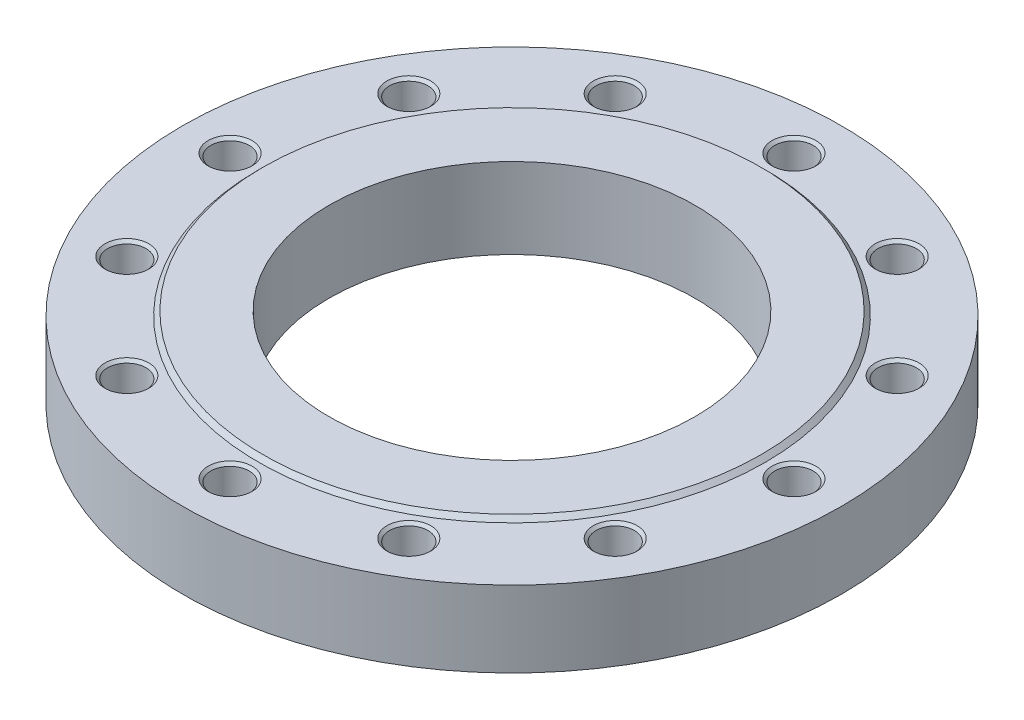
ISO-10303-21;
HEADER;
FILE_DESCRIPTION(('STEP AP214'),'2;1');
FILE_NAME('part.step','',(''),(''),'','','');
FILE_SCHEMA(('AUTOMOTIVE_DESIGN { 1 0 10303 214 1 1 1 1 }'));
ENDSEC;
DATA;
#1=APPLICATION_CONTEXT('core data for automotive mechanical design processes');
#2=APPLICATION_PROTOCOL_DEFINITION('international standard','automotive_design',2000,#1);
#3=PRODUCT_CONTEXT('',#1,'mechanical');
#4=PRODUCT('Part','Part','',(#3));
#5=PRODUCT_RELATED_PRODUCT_CATEGORY('part','',(#4));
#6=PRODUCT_DEFINITION_FORMATION('','',#4);
#7=PRODUCT_DEFINITION_CONTEXT('part definition',#1,'design');
#8=PRODUCT_DEFINITION('design','',#6,#7);
#9=PRODUCT_DEFINITION_SHAPE('','',#8);
#10=(LENGTH_UNIT() NAMED_UNIT(*) SI_UNIT(.MILLI.,.METRE.));
#11=(NAMED_UNIT(*) PLANE_ANGLE_UNIT() SI_UNIT($,.RADIAN.));
#12=(NAMED_UNIT(*) SI_UNIT($,.STERADIAN.) SOLID_ANGLE_UNIT());
#13=UNCERTAINTY_MEASURE_WITH_UNIT(LENGTH_MEASURE(1.E-05),#10,'distance_accuracy_value','');
#14=(GEOMETRIC_REPRESENTATION_CONTEXT(3) GLOBAL_UNCERTAINTY_ASSIGNED_CONTEXT((#13)) GLOBAL_UNIT_ASSIGNED_CONTEXT((#10,
#11,#12)) REPRESENTATION_CONTEXT('',''));
#15=CARTESIAN_POINT('',(0.,0.,0.));
#16=DIRECTION('',(0.,0.,1.));
#17=DIRECTION('',(1.,0.,0.));
#18=AXIS2_PLACEMENT_3D('',#15,#16,#17);
#19=CARTESIAN_POINT('',(0.,26.,0.));
#20=DIRECTION('',(0.,-1.,0.));
#21=DIRECTION('',(1.,0.,0.));
#22=AXIS2_PLACEMENT_3D('',#19,#20,#21);
#23=CYLINDRICAL_SURFACE('',#22,225.);
#24=CARTESIAN_POINT('',(0.,0.,0.));
#25=DIRECTION('',(0.,1.,0.));
#26=DIRECTION('',(1.,0.,0.));
#27=AXIS2_PLACEMENT_3D('',#24,#25,#26);
#28=CIRCLE('',#27,225.);
#29=CARTESIAN_POINT('',(225.,0.,0.));
#30=VERTEX_POINT('',#29);
#31=EDGE_CURVE('E9',#30,#30,#28,.T.);
#32=ORIENTED_EDGE('',*,*,#31,.T.);
#33=EDGE_LOOP('',(#32));
#34=FACE_BOUND('',#33,.T.);
#35=CARTESIAN_POINT('',(0.,52.,0.));
#36=DIRECTION('',(0.,1.,0.));
#37=DIRECTION('',(1.,0.,0.));
#38=AXIS2_PLACEMENT_3D('',#35,#36,#37);
#39=CIRCLE('',#38,225.);
#40=CARTESIAN_POINT('',(225.,52.,0.));
#41=VERTEX_POINT('',#40);
#42=EDGE_CURVE('E405',#41,#41,#39,.T.);
#43=ORIENTED_EDGE('',*,*,#42,.F.);
#44=EDGE_LOOP('',(#43));
#45=FACE_BOUND('',#44,.T.);
#46=ADVANCED_FACE('F15',(#34,#45),#23,.T.);
#47=CARTESIAN_POINT('',(175.,0.,0.));
#48=DIRECTION('',(0.,-1.,0.));
#49=DIRECTION('',(-1.,0.,0.));
#50=AXIS2_PLACEMENT_3D('',#47,#48,#49);
#51=PLANE('',#50);
#52=CARTESIAN_POINT('',(0.,0.,0.));
#53=DIRECTION('',(0.,1.,0.));
#54=DIRECTION('',(1.,0.,0.));
#55=AXIS2_PLACEMENT_3D('',#52,#53,#54);
#56=CIRCLE('',#55,125.);
#57=CARTESIAN_POINT('',(125.,0.,0.));
#58=VERTEX_POINT('',#57);
#59=EDGE_CURVE('E23',#58,#58,#56,.T.);
#60=ORIENTED_EDGE('',*,*,#59,.T.);
#61=EDGE_LOOP('',(#60));
#62=FACE_BOUND('',#61,.T.);
#63=ORIENTED_EDGE('',*,*,#31,.F.);
#64=EDGE_LOOP('',(#63));
#65=FACE_BOUND('',#64,.T.);
#66=ADVANCED_FACE('F17',(#62,#65),#51,.T.);
#67=CARTESIAN_POINT('',(0.,27.5,0.));
#68=DIRECTION('',(0.,-1.,0.));
#69=DIRECTION('',(1.,0.,0.));
#70=AXIS2_PLACEMENT_3D('',#67,#68,#69);
#71=CYLINDRICAL_SURFACE('',#70,125.);
#72=CARTESIAN_POINT('',(0.,55.,0.));
#73=DIRECTION('',(0.,1.,0.));
#74=DIRECTION('',(1.,0.,0.));
#75=AXIS2_PLACEMENT_3D('',#72,#73,#74);
#76=CIRCLE('',#75,125.);
#77=CARTESIAN_POINT('',(125.,55.,0.));
#78=VERTEX_POINT('',#77);
#79=EDGE_CURVE('E411',#78,#78,#76,.T.);
#80=ORIENTED_EDGE('',*,*,#79,.T.);
#81=EDGE_LOOP('',(#80));
#82=FACE_BOUND('',#81,.T.);
#83=ORIENTED_EDGE('',*,*,#59,.F.);
#84=EDGE_LOOP('',(#83));
#85=FACE_BOUND('',#84,.T.);
#86=ADVANCED_FACE('F530',(#82,#85),#71,.F.);
#87=CARTESIAN_POINT('',(147.5,55.,0.));
#88=DIRECTION('',(0.,1.,0.));
#89=DIRECTION('',(1.,0.,0.));
#90=AXIS2_PLACEMENT_3D('',#87,#88,#89);
#91=PLANE('',#90);
#92=CARTESIAN_POINT('',(0.,55.,0.));
#93=DIRECTION('',(0.,1.,0.));
#94=DIRECTION('',(1.,0.,0.));
#95=AXIS2_PLACEMENT_3D('',#92,#93,#94);
#96=CIRCLE('',#95,170.);
#97=CARTESIAN_POINT('',(170.,55.,0.));
#98=VERTEX_POINT('',#97);
#99=EDGE_CURVE('E407',#98,#98,#96,.T.);
#100=ORIENTED_EDGE('',*,*,#99,.T.);
#101=EDGE_LOOP('',(#100));
#102=FACE_BOUND('',#101,.T.);
#103=ORIENTED_EDGE('',*,*,#79,.F.);
#104=EDGE_LOOP('',(#103));
#105=FACE_BOUND('',#104,.T.);
#106=ADVANCED_FACE('F630',(#102,#105),#91,.T.);
#107=CARTESIAN_POINT('',(0.,53.5,0.));
#108=DIRECTION('',(0.,-1.,0.));
#109=DIRECTION('',(1.,0.,0.));
#110=AXIS2_PLACEMENT_3D('',#107,#108,#109);
#111=CONICAL_SURFACE('',#110,171.5,0.785398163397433);
#112=CARTESIAN_POINT('',(0.,52.,0.));
#113=DIRECTION('',(0.,1.,0.));
#114=DIRECTION('',(1.,0.,0.));
#115=AXIS2_PLACEMENT_3D('',#112,#113,#114);
#116=CIRCLE('',#115,173.);
#117=CARTESIAN_POINT('',(173.,52.,0.));
#118=VERTEX_POINT('',#117);
#119=EDGE_CURVE('E408',#118,#118,#116,.T.);
#120=ORIENTED_EDGE('',*,*,#119,.T.);
#121=EDGE_LOOP('',(#120));
#122=FACE_BOUND('',#121,.T.);
#123=ORIENTED_EDGE('',*,*,#99,.F.);
#124=EDGE_LOOP('',(#123));
#125=FACE_BOUND('',#124,.T.);
#126=ADVANCED_FACE('F453',(#122,#125),#111,.T.);
#127=CARTESIAN_POINT('',(199.,52.,0.));
#128=DIRECTION('',(0.,1.,0.));
#129=DIRECTION('',(1.,0.,0.));
#130=AXIS2_PLACEMENT_3D('',#127,#128,#129);
#131=PLANE('',#130);
#132=ORIENTED_EDGE('',*,*,#42,.T.);
#133=EDGE_LOOP('',(#132));
#134=FACE_BOUND('',#133,.T.);
#135=ORIENTED_EDGE('',*,*,#119,.F.);
#136=EDGE_LOOP('',(#135));
#137=FACE_BOUND('',#136,.T.);
#138=CARTESIAN_POINT('',(192.5,52.,0.));
#139=DIRECTION('',(0.,-1.,0.));
#140=DIRECTION('',(1.,0.,0.));
#141=AXIS2_PLACEMENT_3D('',#138,#139,#140);
#142=CIRCLE('',#141,15.);
#143=CARTESIAN_POINT('',(207.5,52.,0.));
#144=VERTEX_POINT('',#143);
#145=EDGE_CURVE('E445',#144,#144,#142,.T.);
#146=ORIENTED_EDGE('',*,*,#145,.T.);
#147=EDGE_LOOP('',(#146));
#148=FACE_BOUND('',#147,.T.);
#149=CARTESIAN_POINT('',(166.709890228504,52.,-96.25));
#150=DIRECTION('',(0.,-1.,0.));
#151=DIRECTION('',(0.866025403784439,0.,-0.5));
#152=AXIS2_PLACEMENT_3D('',#149,#150,#151);
#153=CIRCLE('',#152,15.);
#154=CARTESIAN_POINT('',(179.700271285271,52.,-103.75));
#155=VERTEX_POINT('',#154);
#156=EDGE_CURVE('E345',#155,#155,#153,.T.);
#157=ORIENTED_EDGE('',*,*,#156,.T.);
#158=EDGE_LOOP('',(#157));
#159=FACE_BOUND('',#158,.T.);
#160=CARTESIAN_POINT('',(96.25,52.,-166.709890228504));
#161=DIRECTION('',(0.,-1.,0.));
#162=DIRECTION('',(0.5,0.,-0.866025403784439));
#163=AXIS2_PLACEMENT_3D('',#160,#161,#162);
#164=CIRCLE('',#163,15.);
#165=CARTESIAN_POINT('',(103.75,52.,-179.700271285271));
#166=VERTEX_POINT('',#165);
#167=EDGE_CURVE('E352',#166,#166,#164,.T.);
#168=ORIENTED_EDGE('',*,*,#167,.T.);
#169=EDGE_LOOP('',(#168));
#170=FACE_BOUND('',#169,.T.);
#171=CARTESIAN_POINT('',(0.,52.,-192.5));
#172=DIRECTION('',(0.,-1.,0.));
#173=DIRECTION('',(0.,0.,-1.));
#174=AXIS2_PLACEMENT_3D('',#171,#172,#173);
#175=CIRCLE('',#174,15.);
#176=CARTESIAN_POINT('',(0.,52.,-207.5));
#177=VERTEX_POINT('',#176);
#178=EDGE_CURVE('E423',#177,#177,#175,.T.);
#179=ORIENTED_EDGE('',*,*,#178,.T.);
#180=EDGE_LOOP('',(#179));
#181=FACE_BOUND('',#180,.T.);
#182=CARTESIAN_POINT('',(-96.25,52.,-166.709890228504));
#183=DIRECTION('',(0.,-1.,0.));
#184=DIRECTION('',(-0.5,0.,-0.866025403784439));
#185=AXIS2_PLACEMENT_3D('',#182,#183,#184);
#186=CIRCLE('',#185,15.);
#187=CARTESIAN_POINT('',(-103.75,52.,-179.700271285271));
#188=VERTEX_POINT('',#187);
#189=EDGE_CURVE('E340',#188,#188,#186,.T.);
#190=ORIENTED_EDGE('',*,*,#189,.T.);
#191=EDGE_LOOP('',(#190));
#192=FACE_BOUND('',#191,.T.);
#193=CARTESIAN_POINT('',(-166.709890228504,52.,-96.25));
#194=DIRECTION('',(0.,-1.,0.));
#195=DIRECTION('',(-0.866025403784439,0.,-0.5));
#196=AXIS2_PLACEMENT_3D('',#193,#194,#195);
#197=CIRCLE('',#196,15.);
#198=CARTESIAN_POINT('',(-179.700271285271,52.,-103.75));
#199=VERTEX_POINT('',#198);
#200=EDGE_CURVE('E400',#199,#199,#197,.T.);
#201=ORIENTED_EDGE('',*,*,#200,.T.);
#202=EDGE_LOOP('',(#201));
#203=FACE_BOUND('',#202,.T.);
#204=CARTESIAN_POINT('',(-192.5,52.,0.));
#205=DIRECTION('',(0.,-1.,0.));
#206=DIRECTION('',(-1.,0.,0.));
#207=AXIS2_PLACEMENT_3D('',#204,#205,#206);
#208=CIRCLE('',#207,15.);
#209=CARTESIAN_POINT('',(-207.5,52.,0.));
#210=VERTEX_POINT('',#209);
#211=EDGE_CURVE('E393',#210,#210,#208,.T.);
#212=ORIENTED_EDGE('',*,*,#211,.T.);
#213=EDGE_LOOP('',(#212));
#214=FACE_BOUND('',#213,.T.);
#215=CARTESIAN_POINT('',(-166.709890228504,52.,96.25));
#216=DIRECTION('',(0.,-1.,0.));
#217=DIRECTION('',(-0.866025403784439,0.,0.5));
#218=AXIS2_PLACEMENT_3D('',#215,#216,#217);
#219=CIRCLE('',#218,15.);
#220=CARTESIAN_POINT('',(-179.700271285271,52.,103.75));
#221=VERTEX_POINT('',#220);
#222=EDGE_CURVE('E381',#221,#221,#219,.T.);
#223=ORIENTED_EDGE('',*,*,#222,.T.);
#224=EDGE_LOOP('',(#223));
#225=FACE_BOUND('',#224,.T.);
#226=CARTESIAN_POINT('',(-96.25,52.,166.709890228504));
#227=DIRECTION('',(0.,-1.,0.));
#228=DIRECTION('',(-0.5,0.,0.866025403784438));
#229=AXIS2_PLACEMENT_3D('',#226,#227,#228);
#230=CIRCLE('',#229,15.);
#231=CARTESIAN_POINT('',(-103.75,52.,179.700271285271));
#232=VERTEX_POINT('',#231);
#233=EDGE_CURVE('E366',#232,#232,#230,.T.);
#234=ORIENTED_EDGE('',*,*,#233,.T.);
#235=EDGE_LOOP('',(#234));
#236=FACE_BOUND('',#235,.T.);
#237=CARTESIAN_POINT('',(0.,52.,192.5));
#238=DIRECTION('',(0.,-1.,0.));
#239=DIRECTION('',(0.,0.,1.));
#240=AXIS2_PLACEMENT_3D('',#237,#238,#239);
#241=CIRCLE('',#240,15.);
#242=CARTESIAN_POINT('',(0.,52.,207.5));
#243=VERTEX_POINT('',#242);
#244=EDGE_CURVE('E321',#243,#243,#241,.T.);
#245=ORIENTED_EDGE('',*,*,#244,.T.);
#246=EDGE_LOOP('',(#245));
#247=FACE_BOUND('',#246,.T.);
#248=CARTESIAN_POINT('',(96.25,52.,166.709890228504));
#249=DIRECTION('',(0.,-1.,0.));
#250=DIRECTION('',(0.5,0.,0.866025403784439));
#251=AXIS2_PLACEMENT_3D('',#248,#249,#250);
#252=CIRCLE('',#251,15.);
#253=CARTESIAN_POINT('',(103.75,52.,179.700271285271));
#254=VERTEX_POINT('',#253);
#255=EDGE_CURVE('E296',#254,#254,#252,.T.);
#256=ORIENTED_EDGE('',*,*,#255,.T.);
#257=EDGE_LOOP('',(#256));
#258=FACE_BOUND('',#257,.T.);
#259=CARTESIAN_POINT('',(166.709890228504,52.,96.25));
#260=DIRECTION('',(0.,-1.,0.));
#261=DIRECTION('',(0.866025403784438,0.,0.5));
#262=AXIS2_PLACEMENT_3D('',#259,#260,#261);
#263=CIRCLE('',#262,15.);
#264=CARTESIAN_POINT('',(179.700271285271,52.,103.75));
#265=VERTEX_POINT('',#264);
#266=EDGE_CURVE('E318',#265,#265,#263,.T.);
#267=ORIENTED_EDGE('',*,*,#266,.T.);
#268=EDGE_LOOP('',(#267));
#269=FACE_BOUND('',#268,.T.);
#270=ADVANCED_FACE('F297',(#134,#137,#148,#159,#170,#181,#192,#203,#214,#225,#236,#247,#258,
#269),#131,.T.);
#271=CARTESIAN_POINT('',(192.5,8.21673193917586,0.));
#272=DIRECTION('',(0.,1.,0.));
#273=DIRECTION('',(1.,0.,0.));
#274=AXIS2_PLACEMENT_3D('',#271,#272,#273);
#275=CONICAL_SURFACE('',#274,6.5528125,1.0471975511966);
#276=CARTESIAN_POINT('',(192.5,12.,0.));
#277=DIRECTION('',(0.,-1.,0.));
#278=DIRECTION('',(1.,0.,0.));
#279=AXIS2_PLACEMENT_3D('',#276,#277,#278);
#280=CIRCLE('',#279,13.105625);
#281=CARTESIAN_POINT('',(205.605625,12.,0.));
#282=VERTEX_POINT('',#281);
#283=EDGE_CURVE('E435',#282,#282,#280,.T.);
#284=ORIENTED_EDGE('',*,*,#283,.F.);
#285=EDGE_LOOP('',(#284));
#286=FACE_BOUND('',#285,.T.);
#287=CARTESIAN_POINT('',(192.5,4.43346387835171,0.));
#288=VERTEX_POINT('',#287);
#289=VERTEX_LOOP('',#288);
#290=FACE_BOUND('',#289,.T.);
#291=ADVANCED_FACE('F458',(#286,#290),#275,.F.);
#292=CARTESIAN_POINT('',(192.5,16.0528125,0.));
#293=DIRECTION('',(0.,1.,0.));
#294=DIRECTION('',(1.,0.,0.));
#295=AXIS2_PLACEMENT_3D('',#292,#293,#294);
#296=CYLINDRICAL_SURFACE('',#295,13.105625);
#297=CARTESIAN_POINT('',(192.5,20.105625,0.));
#298=DIRECTION('',(0.,-1.,0.));
#299=DIRECTION('',(1.,0.,0.));
#300=AXIS2_PLACEMENT_3D('',#297,#298,#299);
#301=CIRCLE('',#300,13.105625);
#302=CARTESIAN_POINT('',(205.605625,20.105625,0.));
#303=VERTEX_POINT('',#302);
#304=EDGE_CURVE('E437',#303,#303,#301,.T.);
#305=ORIENTED_EDGE('',*,*,#304,.F.);
#306=EDGE_LOOP('',(#305));
#307=FACE_BOUND('',#306,.T.);
#308=ORIENTED_EDGE('',*,*,#283,.T.);
#309=EDGE_LOOP('',(#308));
#310=FACE_BOUND('',#309,.T.);
#311=ADVANCED_FACE('F573',(#307,#310),#296,.F.);
#312=CARTESIAN_POINT('',(192.5,21.0528125,0.));
#313=DIRECTION('',(0.,1.,0.));
#314=DIRECTION('',(1.,0.,0.));
#315=AXIS2_PLACEMENT_3D('',#312,#313,#314);
#316=CONICAL_SURFACE('',#315,14.0528125,0.785398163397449);
#317=CARTESIAN_POINT('',(192.5,22.,0.));
#318=DIRECTION('',(0.,-1.,0.));
#319=DIRECTION('',(1.,0.,0.));
#320=AXIS2_PLACEMENT_3D('',#317,#318,#319);
#321=CIRCLE('',#320,15.);
#322=CARTESIAN_POINT('',(207.5,22.,0.));
#323=VERTEX_POINT('',#322);
#324=EDGE_CURVE('E449',#323,#323,#321,.T.);
#325=ORIENTED_EDGE('',*,*,#324,.F.);
#326=EDGE_LOOP('',(#325));
#327=FACE_BOUND('',#326,.T.);
#328=ORIENTED_EDGE('',*,*,#304,.T.);
#329=EDGE_LOOP('',(#328));
#330=FACE_BOUND('',#329,.T.);
#331=ADVANCED_FACE('F625',(#327,#330),#316,.F.);
#332=CARTESIAN_POINT('',(206.5528125,22.,0.));
#333=DIRECTION('',(0.,1.,0.));
#334=DIRECTION('',(-1.,0.,0.));
#335=AXIS2_PLACEMENT_3D('',#332,#333,#334);
#336=PLANE('',#335);
#337=CARTESIAN_POINT('',(192.5,22.,0.));
#338=DIRECTION('',(0.,-1.,0.));
#339=DIRECTION('',(1.,0.,0.));
#340=AXIS2_PLACEMENT_3D('',#337,#338,#339);
#341=CIRCLE('',#340,13.105625);
#342=CARTESIAN_POINT('',(205.605625,22.,0.));
#343=VERTEX_POINT('',#342);
#344=EDGE_CURVE('E447',#343,#343,#341,.T.);
#345=ORIENTED_EDGE('',*,*,#344,.F.);
#346=EDGE_LOOP('',(#345));
#347=FACE_BOUND('',#346,.T.);
#348=ORIENTED_EDGE('',*,*,#324,.T.);
#349=EDGE_LOOP('',(#348));
#350=FACE_BOUND('',#349,.T.);
#351=ADVANCED_FACE('F621',(#347,#350),#336,.F.);
#352=CARTESIAN_POINT('',(192.5,36.0528125,0.));
#353=DIRECTION('',(0.,1.,0.));
#354=DIRECTION('',(1.,0.,0.));
#355=AXIS2_PLACEMENT_3D('',#352,#353,#354);
#356=CYLINDRICAL_SURFACE('',#355,13.105625);
#357=CARTESIAN_POINT('',(192.5,50.105625,0.));
#358=DIRECTION('',(0.,-1.,0.));
#359=DIRECTION('',(1.,0.,0.));
#360=AXIS2_PLACEMENT_3D('',#357,#358,#359);
#361=CIRCLE('',#360,13.105625);
#362=CARTESIAN_POINT('',(205.605625,50.105625,0.));
#363=VERTEX_POINT('',#362);
#364=EDGE_CURVE('E377',#363,#363,#361,.T.);
#365=ORIENTED_EDGE('',*,*,#364,.F.);
#366=EDGE_LOOP('',(#365));
#367=FACE_BOUND('',#366,.T.);
#368=ORIENTED_EDGE('',*,*,#344,.T.);
#369=EDGE_LOOP('',(#368));
#370=FACE_BOUND('',#369,.T.);
#371=ADVANCED_FACE('F617',(#367,#370),#356,.F.);
#372=CARTESIAN_POINT('',(192.5,51.0528125,0.));
#373=DIRECTION('',(0.,1.,0.));
#374=DIRECTION('',(1.,0.,0.));
#375=AXIS2_PLACEMENT_3D('',#372,#373,#374);
#376=CONICAL_SURFACE('',#375,14.0528125,0.785398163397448);
#377=ORIENTED_EDGE('',*,*,#145,.F.);
#378=EDGE_LOOP('',(#377));
#379=FACE_BOUND('',#378,.T.);
#380=ORIENTED_EDGE('',*,*,#364,.T.);
#381=EDGE_LOOP('',(#380));
#382=FACE_BOUND('',#381,.T.);
#383=ADVANCED_FACE('F613',(#379,#382),#376,.F.);
#384=CARTESIAN_POINT('',(166.709890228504,8.21673193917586,-96.25));
#385=DIRECTION('',(0.,1.,0.));
#386=DIRECTION('',(0.866025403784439,0.,-0.5));
#387=AXIS2_PLACEMENT_3D('',#384,#385,#386);
#388=CONICAL_SURFACE('',#387,6.5528125,1.0471975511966);
#389=CARTESIAN_POINT('',(166.709890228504,12.,-96.25));
#390=DIRECTION('',(0.,-1.,0.));
#391=DIRECTION('',(0.866025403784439,0.,-0.5));
#392=AXIS2_PLACEMENT_3D('',#389,#390,#391);
#393=CIRCLE('',#392,13.105625);
#394=CARTESIAN_POINT('',(178.059694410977,12.,-102.8028125));
#395=VERTEX_POINT('',#394);
#396=EDGE_CURVE('E375',#395,#395,#393,.T.);
#397=ORIENTED_EDGE('',*,*,#396,.F.);
#398=EDGE_LOOP('',(#397));
#399=FACE_BOUND('',#398,.T.);
#400=CARTESIAN_POINT('',(166.709890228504,4.43346387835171,-96.25));
#401=VERTEX_POINT('',#400);
#402=VERTEX_LOOP('',#401);
#403=FACE_BOUND('',#402,.T.);
#404=ADVANCED_FACE('F609',(#399,#403),#388,.F.);
#405=CARTESIAN_POINT('',(166.709890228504,16.0528125,-96.25));
#406=DIRECTION('',(0.,1.,0.));
#407=DIRECTION('',(0.866025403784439,0.,-0.5));
#408=AXIS2_PLACEMENT_3D('',#405,#406,#407);
#409=CYLINDRICAL_SURFACE('',#408,13.105625);
#410=CARTESIAN_POINT('',(166.709890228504,20.105625,-96.25));
#411=DIRECTION('',(0.,-1.,0.));
#412=DIRECTION('',(0.866025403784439,0.,-0.5));
#413=AXIS2_PLACEMENT_3D('',#410,#411,#412);
#414=CIRCLE('',#413,13.105625);
#415=CARTESIAN_POINT('',(178.059694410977,20.105625,-102.8028125));
#416=VERTEX_POINT('',#415);
#417=EDGE_CURVE('E309',#416,#416,#414,.T.);
#418=ORIENTED_EDGE('',*,*,#417,.F.);
#419=EDGE_LOOP('',(#418));
#420=FACE_BOUND('',#419,.T.);
#421=ORIENTED_EDGE('',*,*,#396,.T.);
#422=EDGE_LOOP('',(#421));
#423=FACE_BOUND('',#422,.T.);
#424=ADVANCED_FACE('F606',(#420,#423),#409,.F.);
#425=CARTESIAN_POINT('',(166.709890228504,21.0528125,-96.25));
#426=DIRECTION('',(0.,1.,0.));
#427=DIRECTION('',(0.866025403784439,0.,-0.5));
#428=AXIS2_PLACEMENT_3D('',#425,#426,#427);
#429=CONICAL_SURFACE('',#428,14.0528125,0.785398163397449);
#430=CARTESIAN_POINT('',(166.709890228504,22.,-96.25));
#431=DIRECTION('',(0.,-1.,0.));
#432=DIRECTION('',(0.866025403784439,0.,-0.5));
#433=AXIS2_PLACEMENT_3D('',#430,#431,#432);
#434=CIRCLE('',#433,15.);
#435=CARTESIAN_POINT('',(179.700271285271,22.,-103.75));
#436=VERTEX_POINT('',#435);
#437=EDGE_CURVE('E442',#436,#436,#434,.T.);
#438=ORIENTED_EDGE('',*,*,#437,.F.);
#439=EDGE_LOOP('',(#438));
#440=FACE_BOUND('',#439,.T.);
#441=ORIENTED_EDGE('',*,*,#417,.T.);
#442=EDGE_LOOP('',(#441));
#443=FACE_BOUND('',#442,.T.);
#444=ADVANCED_FACE('F604',(#440,#443),#429,.F.);
#445=CARTESIAN_POINT('',(178.879982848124,22.,-103.27640625));
#446=DIRECTION('',(0.,1.,0.));
#447=DIRECTION('',(-0.866025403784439,0.,0.5));
#448=AXIS2_PLACEMENT_3D('',#445,#446,#447);
#449=PLANE('',#448);
#450=CARTESIAN_POINT('',(166.709890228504,22.,-96.25));
#451=DIRECTION('',(0.,-1.,0.));
#452=DIRECTION('',(0.866025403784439,0.,-0.5));
#453=AXIS2_PLACEMENT_3D('',#450,#451,#452);
#454=CIRCLE('',#453,13.105625);
#455=CARTESIAN_POINT('',(178.059694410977,22.,-102.8028125));
#456=VERTEX_POINT('',#455);
#457=EDGE_CURVE('E347',#456,#456,#454,.T.);
#458=ORIENTED_EDGE('',*,*,#457,.F.);
#459=EDGE_LOOP('',(#458));
#460=FACE_BOUND('',#459,.T.);
#461=ORIENTED_EDGE('',*,*,#437,.T.);
#462=EDGE_LOOP('',(#461));
#463=FACE_BOUND('',#462,.T.);
#464=ADVANCED_FACE('F601',(#460,#463),#449,.F.);
#465=CARTESIAN_POINT('',(166.709890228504,36.0528125,-96.25));
#466=DIRECTION('',(0.,1.,0.));
#467=DIRECTION('',(0.866025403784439,0.,-0.5));
#468=AXIS2_PLACEMENT_3D('',#465,#466,#467);
#469=CYLINDRICAL_SURFACE('',#468,13.105625);
#470=CARTESIAN_POINT('',(166.709890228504,50.105625,-96.25));
#471=DIRECTION('',(0.,-1.,0.));
#472=DIRECTION('',(0.866025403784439,0.,-0.5));
#473=AXIS2_PLACEMENT_3D('',#470,#471,#472);
#474=CIRCLE('',#473,13.105625);
#475=CARTESIAN_POINT('',(178.059694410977,50.105625,-102.8028125));
#476=VERTEX_POINT('',#475);
#477=EDGE_CURVE('E348',#476,#476,#474,.T.);
#478=ORIENTED_EDGE('',*,*,#477,.F.);
#479=EDGE_LOOP('',(#478));
#480=FACE_BOUND('',#479,.T.);
#481=ORIENTED_EDGE('',*,*,#457,.T.);
#482=EDGE_LOOP('',(#481));
#483=FACE_BOUND('',#482,.T.);
#484=ADVANCED_FACE('F599',(#480,#483),#469,.F.);
#485=CARTESIAN_POINT('',(166.709890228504,51.0528125,-96.25));
#486=DIRECTION('',(0.,1.,0.));
#487=DIRECTION('',(0.866025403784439,0.,-0.5));
#488=AXIS2_PLACEMENT_3D('',#485,#486,#487);
#489=CONICAL_SURFACE('',#488,14.0528125,0.785398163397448);
#490=ORIENTED_EDGE('',*,*,#156,.F.);
#491=EDGE_LOOP('',(#490));
#492=FACE_BOUND('',#491,.T.);
#493=ORIENTED_EDGE('',*,*,#477,.T.);
#494=EDGE_LOOP('',(#493));
#495=FACE_BOUND('',#494,.T.);
#496=ADVANCED_FACE('F596',(#492,#495),#489,.F.);
#497=CARTESIAN_POINT('',(96.25,8.21673193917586,-166.709890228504));
#498=DIRECTION('',(0.,1.,0.));
#499=DIRECTION('',(0.5,0.,-0.866025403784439));
#500=AXIS2_PLACEMENT_3D('',#497,#498,#499);
#501=CONICAL_SURFACE('',#500,6.5528125,1.0471975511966);
#502=CARTESIAN_POINT('',(96.25,12.,-166.709890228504));
#503=DIRECTION('',(0.,-1.,0.));
#504=DIRECTION('',(0.5,0.,-0.866025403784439));
#505=AXIS2_PLACEMENT_3D('',#502,#503,#504);
#506=CIRCLE('',#505,13.105625);
#507=CARTESIAN_POINT('',(102.8028125,12.,-178.059694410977));
#508=VERTEX_POINT('',#507);
#509=EDGE_CURVE('E330',#508,#508,#506,.T.);
#510=ORIENTED_EDGE('',*,*,#509,.F.);
#511=EDGE_LOOP('',(#510));
#512=FACE_BOUND('',#511,.T.);
#513=CARTESIAN_POINT('',(96.25,4.43346387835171,-166.709890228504));
#514=VERTEX_POINT('',#513);
#515=VERTEX_LOOP('',#514);
#516=FACE_BOUND('',#515,.T.);
#517=ADVANCED_FACE('F594',(#512,#516),#501,.F.);
#518=CARTESIAN_POINT('',(96.25,16.0528125,-166.709890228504));
#519=DIRECTION('',(0.,1.,0.));
#520=DIRECTION('',(0.5,0.,-0.866025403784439));
#521=AXIS2_PLACEMENT_3D('',#518,#519,#520);
#522=CYLINDRICAL_SURFACE('',#521,13.105625);
#523=CARTESIAN_POINT('',(96.25,20.105625,-166.709890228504));
#524=DIRECTION('',(0.,-1.,0.));
#525=DIRECTION('',(0.5,0.,-0.866025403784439));
#526=AXIS2_PLACEMENT_3D('',#523,#524,#525);
#527=CIRCLE('',#526,13.105625);
#528=CARTESIAN_POINT('',(102.8028125,20.105625,-178.059694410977));
#529=VERTEX_POINT('',#528);
#530=EDGE_CURVE('E328',#529,#529,#527,.T.);
#531=ORIENTED_EDGE('',*,*,#530,.F.);
#532=EDGE_LOOP('',(#531));
#533=FACE_BOUND('',#532,.T.);
#534=ORIENTED_EDGE('',*,*,#509,.T.);
#535=EDGE_LOOP('',(#534));
#536=FACE_BOUND('',#535,.T.);
#537=ADVANCED_FACE('F590',(#533,#536),#522,.F.);
#538=CARTESIAN_POINT('',(96.25,21.0528125,-166.709890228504));
#539=DIRECTION('',(0.,1.,0.));
#540=DIRECTION('',(0.5,0.,-0.866025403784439));
#541=AXIS2_PLACEMENT_3D('',#538,#539,#540);
#542=CONICAL_SURFACE('',#541,14.0528125,0.785398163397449);
#543=CARTESIAN_POINT('',(96.25,22.,-166.709890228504));
#544=DIRECTION('',(0.,-1.,0.));
#545=DIRECTION('',(0.5,0.,-0.866025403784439));
#546=AXIS2_PLACEMENT_3D('',#543,#544,#545);
#547=CIRCLE('',#546,15.);
#548=CARTESIAN_POINT('',(103.75,22.,-179.700271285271));
#549=VERTEX_POINT('',#548);
#550=EDGE_CURVE('E331',#549,#549,#547,.T.);
#551=ORIENTED_EDGE('',*,*,#550,.F.);
#552=EDGE_LOOP('',(#551));
#553=FACE_BOUND('',#552,.T.);
#554=ORIENTED_EDGE('',*,*,#530,.T.);
#555=EDGE_LOOP('',(#554));
#556=FACE_BOUND('',#555,.T.);
#557=ADVANCED_FACE('F587',(#553,#556),#542,.F.);
#558=CARTESIAN_POINT('',(103.27640625,22.,-178.879982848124));
#559=DIRECTION('',(0.,1.,0.));
#560=DIRECTION('',(-0.5,0.,0.866025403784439));
#561=AXIS2_PLACEMENT_3D('',#558,#559,#560);
#562=PLANE('',#561);
#563=CARTESIAN_POINT('',(96.25,22.,-166.709890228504));
#564=DIRECTION('',(0.,-1.,0.));
#565=DIRECTION('',(0.5,0.,-0.866025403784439));
#566=AXIS2_PLACEMENT_3D('',#563,#564,#565);
#567=CIRCLE('',#566,13.105625);
#568=CARTESIAN_POINT('',(102.8028125,22.,-178.059694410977));
#569=VERTEX_POINT('',#568);
#570=EDGE_CURVE('E350',#569,#569,#567,.T.);
#571=ORIENTED_EDGE('',*,*,#570,.F.);
#572=EDGE_LOOP('',(#571));
#573=FACE_BOUND('',#572,.T.);
#574=ORIENTED_EDGE('',*,*,#550,.T.);
#575=EDGE_LOOP('',(#574));
#576=FACE_BOUND('',#575,.T.);
#577=ADVANCED_FACE('F585',(#573,#576),#562,.F.);
#578=CARTESIAN_POINT('',(96.25,36.0528125,-166.709890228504));
#579=DIRECTION('',(0.,1.,0.));
#580=DIRECTION('',(0.5,0.,-0.866025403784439));
#581=AXIS2_PLACEMENT_3D('',#578,#579,#580);
#582=CYLINDRICAL_SURFACE('',#581,13.105625);
#583=CARTESIAN_POINT('',(96.25,50.105625,-166.709890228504));
#584=DIRECTION('',(0.,-1.,0.));
#585=DIRECTION('',(0.5,0.,-0.866025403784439));
#586=AXIS2_PLACEMENT_3D('',#583,#584,#585);
#587=CIRCLE('',#586,13.105625);
#588=CARTESIAN_POINT('',(102.8028125,50.105625,-178.059694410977));
#589=VERTEX_POINT('',#588);
#590=EDGE_CURVE('E433',#589,#589,#587,.T.);
#591=ORIENTED_EDGE('',*,*,#590,.F.);
#592=EDGE_LOOP('',(#591));
#593=FACE_BOUND('',#592,.T.);
#594=ORIENTED_EDGE('',*,*,#570,.T.);
#595=EDGE_LOOP('',(#594));
#596=FACE_BOUND('',#595,.T.);
#597=ADVANCED_FACE('F581',(#593,#596),#582,.F.);
#598=CARTESIAN_POINT('',(96.25,51.0528125,-166.709890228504));
#599=DIRECTION('',(0.,1.,0.));
#600=DIRECTION('',(0.5,0.,-0.866025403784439));
#601=AXIS2_PLACEMENT_3D('',#598,#599,#600);
#602=CONICAL_SURFACE('',#601,14.0528125,0.785398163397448);
#603=ORIENTED_EDGE('',*,*,#167,.F.);
#604=EDGE_LOOP('',(#603));
#605=FACE_BOUND('',#604,.T.);
#606=ORIENTED_EDGE('',*,*,#590,.T.);
#607=EDGE_LOOP('',(#606));
#608=FACE_BOUND('',#607,.T.);
#609=ADVANCED_FACE('F577',(#605,#608),#602,.F.);
#610=CARTESIAN_POINT('',(0.,8.21673193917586,-192.5));
#611=DIRECTION('',(0.,1.,0.));
#612=DIRECTION('',(0.,0.,-1.));
#613=AXIS2_PLACEMENT_3D('',#610,#611,#612);
#614=CONICAL_SURFACE('',#613,6.5528125,1.0471975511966);
#615=CARTESIAN_POINT('',(0.,12.,-192.5));
#616=DIRECTION('',(0.,-1.,0.));
#617=DIRECTION('',(0.,0.,-1.));
#618=AXIS2_PLACEMENT_3D('',#615,#616,#617);
#619=CIRCLE('',#618,13.105625);
#620=CARTESIAN_POINT('',(0.,12.,-205.605625));
#621=VERTEX_POINT('',#620);
#622=EDGE_CURVE('E431',#621,#621,#619,.T.);
#623=ORIENTED_EDGE('',*,*,#622,.F.);
#624=EDGE_LOOP('',(#623));
#625=FACE_BOUND('',#624,.T.);
#626=CARTESIAN_POINT('',(0.,4.43346387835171,-192.5));
#627=VERTEX_POINT('',#626);
#628=VERTEX_LOOP('',#627);
#629=FACE_BOUND('',#628,.T.);
#630=ADVANCED_FACE('F569',(#625,#629),#614,.F.);
#631=CARTESIAN_POINT('',(0.,16.0528125,-192.5));
#632=DIRECTION('',(0.,1.,0.));
#633=DIRECTION('',(0.,0.,-1.));
#634=AXIS2_PLACEMENT_3D('',#631,#632,#633);
#635=CYLINDRICAL_SURFACE('',#634,13.105625);
#636=CARTESIAN_POINT('',(0.,20.105625,-192.5));
#637=DIRECTION('',(0.,-1.,0.));
#638=DIRECTION('',(0.,0.,-1.));
#639=AXIS2_PLACEMENT_3D('',#636,#637,#638);
#640=CIRCLE('',#639,13.105625);
#641=CARTESIAN_POINT('',(0.,20.105625,-205.605625));
#642=VERTEX_POINT('',#641);
#643=EDGE_CURVE('E429',#642,#642,#640,.T.);
#644=ORIENTED_EDGE('',*,*,#643,.F.);
#645=EDGE_LOOP('',(#644));
#646=FACE_BOUND('',#645,.T.);
#647=ORIENTED_EDGE('',*,*,#622,.T.);
#648=EDGE_LOOP('',(#647));
#649=FACE_BOUND('',#648,.T.);
#650=ADVANCED_FACE('F565',(#646,#649),#635,.F.);
#651=CARTESIAN_POINT('',(0.,21.0528125,-192.5));
#652=DIRECTION('',(0.,1.,0.));
#653=DIRECTION('',(0.,0.,-1.));
#654=AXIS2_PLACEMENT_3D('',#651,#652,#653);
#655=CONICAL_SURFACE('',#654,14.0528125,0.785398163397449);
#656=CARTESIAN_POINT('',(0.,22.,-192.5));
#657=DIRECTION('',(0.,-1.,0.));
#658=DIRECTION('',(0.,0.,-1.));
#659=AXIS2_PLACEMENT_3D('',#656,#657,#658);
#660=CIRCLE('',#659,15.);
#661=CARTESIAN_POINT('',(0.,22.,-207.5));
#662=VERTEX_POINT('',#661);
#663=EDGE_CURVE('E427',#662,#662,#660,.T.);
#664=ORIENTED_EDGE('',*,*,#663,.F.);
#665=EDGE_LOOP('',(#664));
#666=FACE_BOUND('',#665,.T.);
#667=ORIENTED_EDGE('',*,*,#643,.T.);
#668=EDGE_LOOP('',(#667));
#669=FACE_BOUND('',#668,.T.);
#670=ADVANCED_FACE('F568',(#666,#669),#655,.F.);
#671=CARTESIAN_POINT('',(0.,22.,-206.5528125));
#672=DIRECTION('',(0.,1.,0.));
#673=DIRECTION('',(0.,0.,1.));
#674=AXIS2_PLACEMENT_3D('',#671,#672,#673);
#675=PLANE('',#674);
#676=CARTESIAN_POINT('',(0.,22.,-192.5));
#677=DIRECTION('',(0.,-1.,0.));
#678=DIRECTION('',(0.,0.,-1.));
#679=AXIS2_PLACEMENT_3D('',#676,#677,#678);
#680=CIRCLE('',#679,13.105625);
#681=CARTESIAN_POINT('',(0.,22.,-205.605625));
#682=VERTEX_POINT('',#681);
#683=EDGE_CURVE('E425',#682,#682,#680,.T.);
#684=ORIENTED_EDGE('',*,*,#683,.F.);
#685=EDGE_LOOP('',(#684));
#686=FACE_BOUND('',#685,.T.);
#687=ORIENTED_EDGE('',*,*,#663,.T.);
#688=EDGE_LOOP('',(#687));
#689=FACE_BOUND('',#688,.T.);
#690=ADVANCED_FACE('F563',(#686,#689),#675,.F.);
#691=CARTESIAN_POINT('',(0.,36.0528125,-192.5));
#692=DIRECTION('',(0.,1.,0.));
#693=DIRECTION('',(0.,0.,-1.));
#694=AXIS2_PLACEMENT_3D('',#691,#692,#693);
#695=CYLINDRICAL_SURFACE('',#694,13.105625);
#696=CARTESIAN_POINT('',(0.,50.105625,-192.5));
#697=DIRECTION('',(0.,-1.,0.));
#698=DIRECTION('',(0.,0.,-1.));
#699=AXIS2_PLACEMENT_3D('',#696,#697,#698);
#700=CIRCLE('',#699,13.105625);
#701=CARTESIAN_POINT('',(0.,50.105625,-205.605625));
#702=VERTEX_POINT('',#701);
#703=EDGE_CURVE('E421',#702,#702,#700,.T.);
#704=ORIENTED_EDGE('',*,*,#703,.F.);
#705=EDGE_LOOP('',(#704));
#706=FACE_BOUND('',#705,.T.);
#707=ORIENTED_EDGE('',*,*,#683,.T.);
#708=EDGE_LOOP('',(#707));
#709=FACE_BOUND('',#708,.T.);
#710=ADVANCED_FACE('F559',(#706,#709),#695,.F.);
#711=CARTESIAN_POINT('',(0.,51.0528125,-192.5));
#712=DIRECTION('',(0.,1.,0.));
#713=DIRECTION('',(0.,0.,-1.));
#714=AXIS2_PLACEMENT_3D('',#711,#712,#713);
#715=CONICAL_SURFACE('',#714,14.0528125,0.785398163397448);
#716=ORIENTED_EDGE('',*,*,#178,.F.);
#717=EDGE_LOOP('',(#716));
#718=FACE_BOUND('',#717,.T.);
#719=ORIENTED_EDGE('',*,*,#703,.T.);
#720=EDGE_LOOP('',(#719));
#721=FACE_BOUND('',#720,.T.);
#722=ADVANCED_FACE('F555',(#718,#721),#715,.F.);
#723=CARTESIAN_POINT('',(-96.25,8.21673193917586,-166.709890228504));
#724=DIRECTION('',(0.,1.,0.));
#725=DIRECTION('',(-0.5,0.,-0.866025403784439));
#726=AXIS2_PLACEMENT_3D('',#723,#724,#725);
#727=CONICAL_SURFACE('',#726,6.5528125,1.0471975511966);
#728=CARTESIAN_POINT('',(-96.25,12.,-166.709890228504));
#729=DIRECTION('',(0.,-1.,0.));
#730=DIRECTION('',(-0.5,0.,-0.866025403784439));
#731=AXIS2_PLACEMENT_3D('',#728,#729,#730);
#732=CIRCLE('',#731,13.105625);
#733=CARTESIAN_POINT('',(-102.8028125,12.,-178.059694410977));
#734=VERTEX_POINT('',#733);
#735=EDGE_CURVE('E419',#734,#734,#732,.T.);
#736=ORIENTED_EDGE('',*,*,#735,.F.);
#737=EDGE_LOOP('',(#736));
#738=FACE_BOUND('',#737,.T.);
#739=CARTESIAN_POINT('',(-96.25,4.43346387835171,-166.709890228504));
#740=VERTEX_POINT('',#739);
#741=VERTEX_LOOP('',#740);
#742=FACE_BOUND('',#741,.T.);
#743=ADVANCED_FACE('F551',(#738,#742),#727,.F.);
#744=CARTESIAN_POINT('',(-96.25,16.0528125,-166.709890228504));
#745=DIRECTION('',(0.,1.,0.));
#746=DIRECTION('',(-0.5,0.,-0.866025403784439));
#747=AXIS2_PLACEMENT_3D('',#744,#745,#746);
#748=CYLINDRICAL_SURFACE('',#747,13.105625);
#749=CARTESIAN_POINT('',(-96.25,20.105625,-166.709890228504));
#750=DIRECTION('',(0.,-1.,0.));
#751=DIRECTION('',(-0.5,0.,-0.866025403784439));
#752=AXIS2_PLACEMENT_3D('',#749,#750,#751);
#753=CIRCLE('',#752,13.105625);
#754=CARTESIAN_POINT('',(-102.8028125,20.105625,-178.059694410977));
#755=VERTEX_POINT('',#754);
#756=EDGE_CURVE('E357',#755,#755,#753,.T.);
#757=ORIENTED_EDGE('',*,*,#756,.F.);
#758=EDGE_LOOP('',(#757));
#759=FACE_BOUND('',#758,.T.);
#760=ORIENTED_EDGE('',*,*,#735,.T.);
#761=EDGE_LOOP('',(#760));
#762=FACE_BOUND('',#761,.T.);
#763=ADVANCED_FACE('F547',(#759,#762),#748,.F.);
#764=CARTESIAN_POINT('',(-96.25,21.0528125,-166.709890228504));
#765=DIRECTION('',(0.,1.,0.));
#766=DIRECTION('',(-0.5,0.,-0.866025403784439));
#767=AXIS2_PLACEMENT_3D('',#764,#765,#766);
#768=CONICAL_SURFACE('',#767,14.0528125,0.785398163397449);
#769=CARTESIAN_POINT('',(-96.25,22.,-166.709890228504));
#770=DIRECTION('',(0.,-1.,0.));
#771=DIRECTION('',(-0.5,0.,-0.866025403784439));
#772=AXIS2_PLACEMENT_3D('',#769,#770,#771);
#773=CIRCLE('',#772,15.);
#774=CARTESIAN_POINT('',(-103.75,22.,-179.700271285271));
#775=VERTEX_POINT('',#774);
#776=EDGE_CURVE('E355',#775,#775,#773,.T.);
#777=ORIENTED_EDGE('',*,*,#776,.F.);
#778=EDGE_LOOP('',(#777));
#779=FACE_BOUND('',#778,.T.);
#780=ORIENTED_EDGE('',*,*,#756,.T.);
#781=EDGE_LOOP('',(#780));
#782=FACE_BOUND('',#781,.T.);
#783=ADVANCED_FACE('F543',(#779,#782),#768,.F.);
#784=CARTESIAN_POINT('',(-103.27640625,22.,-178.879982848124));
#785=DIRECTION('',(0.,1.,0.));
#786=DIRECTION('',(0.5,0.,0.866025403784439));
#787=AXIS2_PLACEMENT_3D('',#784,#785,#786);
#788=PLANE('',#787);
#789=CARTESIAN_POINT('',(-96.25,22.,-166.709890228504));
#790=DIRECTION('',(0.,-1.,0.));
#791=DIRECTION('',(-0.5,0.,-0.866025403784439));
#792=AXIS2_PLACEMENT_3D('',#789,#790,#791);
#793=CIRCLE('',#792,13.105625);
#794=CARTESIAN_POINT('',(-102.8028125,22.,-178.059694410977));
#795=VERTEX_POINT('',#794);
#796=EDGE_CURVE('E342',#795,#795,#793,.T.);
#797=ORIENTED_EDGE('',*,*,#796,.F.);
#798=EDGE_LOOP('',(#797));
#799=FACE_BOUND('',#798,.T.);
#800=ORIENTED_EDGE('',*,*,#776,.T.);
#801=EDGE_LOOP('',(#800));
#802=FACE_BOUND('',#801,.T.);
#803=ADVANCED_FACE('F539',(#799,#802),#788,.F.);
#804=CARTESIAN_POINT('',(-96.25,36.0528125,-166.709890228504));
#805=DIRECTION('',(0.,1.,0.));
#806=DIRECTION('',(-0.5,0.,-0.866025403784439));
#807=AXIS2_PLACEMENT_3D('',#804,#805,#806);
#808=CYLINDRICAL_SURFACE('',#807,13.105625);
#809=CARTESIAN_POINT('',(-96.25,50.105625,-166.709890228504));
#810=DIRECTION('',(0.,-1.,0.));
#811=DIRECTION('',(-0.5,0.,-0.866025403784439));
#812=AXIS2_PLACEMENT_3D('',#809,#810,#811);
#813=CIRCLE('',#812,13.105625);
#814=CARTESIAN_POINT('',(-102.8028125,50.105625,-178.059694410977));
#815=VERTEX_POINT('',#814);
#816=EDGE_CURVE('E343',#815,#815,#813,.T.);
#817=ORIENTED_EDGE('',*,*,#816,.F.);
#818=EDGE_LOOP('',(#817));
#819=FACE_BOUND('',#818,.T.);
#820=ORIENTED_EDGE('',*,*,#796,.T.);
#821=EDGE_LOOP('',(#820));
#822=FACE_BOUND('',#821,.T.);
#823=ADVANCED_FACE('F536',(#819,#822),#808,.F.);
#824=CARTESIAN_POINT('',(-96.25,51.0528125,-166.709890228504));
#825=DIRECTION('',(0.,1.,0.));
#826=DIRECTION('',(-0.5,0.,-0.866025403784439));
#827=AXIS2_PLACEMENT_3D('',#824,#825,#826);
#828=CONICAL_SURFACE('',#827,14.0528125,0.785398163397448);
#829=ORIENTED_EDGE('',*,*,#189,.F.);
#830=EDGE_LOOP('',(#829));
#831=FACE_BOUND('',#830,.T.);
#832=ORIENTED_EDGE('',*,*,#816,.T.);
#833=EDGE_LOOP('',(#832));
#834=FACE_BOUND('',#833,.T.);
#835=ADVANCED_FACE('F534',(#831,#834),#828,.F.);
#836=CARTESIAN_POINT('',(-166.709890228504,8.21673193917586,-96.25));
#837=DIRECTION('',(0.,1.,0.));
#838=DIRECTION('',(-0.866025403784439,0.,-0.5));
#839=AXIS2_PLACEMENT_3D('',#836,#837,#838);
#840=CONICAL_SURFACE('',#839,6.5528125,1.0471975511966);
#841=CARTESIAN_POINT('',(-166.709890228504,12.,-96.25));
#842=DIRECTION('',(0.,-1.,0.));
#843=DIRECTION('',(-0.866025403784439,0.,-0.5));
#844=AXIS2_PLACEMENT_3D('',#841,#842,#843);
#845=CIRCLE('',#844,13.105625);
#846=CARTESIAN_POINT('',(-178.059694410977,12.,-102.8028125));
#847=VERTEX_POINT('',#846);
#848=EDGE_CURVE('E396',#847,#847,#845,.T.);
#849=ORIENTED_EDGE('',*,*,#848,.F.);
#850=EDGE_LOOP('',(#849));
#851=FACE_BOUND('',#850,.T.);
#852=CARTESIAN_POINT('',(-166.709890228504,4.43346387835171,-96.25));
#853=VERTEX_POINT('',#852);
#854=VERTEX_LOOP('',#853);
#855=FACE_BOUND('',#854,.T.);
#856=ADVANCED_FACE('F645',(#851,#855),#840,.F.);
#857=CARTESIAN_POINT('',(-166.709890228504,16.0528125,-96.25));
#858=DIRECTION('',(0.,1.,0.));
#859=DIRECTION('',(-0.866025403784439,0.,-0.5));
#860=AXIS2_PLACEMENT_3D('',#857,#858,#859);
#861=CYLINDRICAL_SURFACE('',#860,13.105625);
#862=CARTESIAN_POINT('',(-166.709890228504,20.105625,-96.25));
#863=DIRECTION('',(0.,-1.,0.));
#864=DIRECTION('',(-0.866025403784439,0.,-0.5));
#865=AXIS2_PLACEMENT_3D('',#862,#863,#864);
#866=CIRCLE('',#865,13.105625);
#867=CARTESIAN_POINT('',(-178.059694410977,20.105625,-102.8028125));
#868=VERTEX_POINT('',#867);
#869=EDGE_CURVE('E410',#868,#868,#866,.T.);
#870=ORIENTED_EDGE('',*,*,#869,.F.);
#871=EDGE_LOOP('',(#870));
#872=FACE_BOUND('',#871,.T.);
#873=ORIENTED_EDGE('',*,*,#848,.T.);
#874=EDGE_LOOP('',(#873));
#875=FACE_BOUND('',#874,.T.);
#876=ADVANCED_FACE('F647',(#872,#875),#861,.F.);
#877=CARTESIAN_POINT('',(-166.709890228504,21.0528125,-96.25));
#878=DIRECTION('',(0.,1.,0.));
#879=DIRECTION('',(-0.866025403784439,0.,-0.5));
#880=AXIS2_PLACEMENT_3D('',#877,#878,#879);
#881=CONICAL_SURFACE('',#880,14.0528125,0.785398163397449);
#882=CARTESIAN_POINT('',(-166.709890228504,22.,-96.25));
#883=DIRECTION('',(0.,-1.,0.));
#884=DIRECTION('',(-0.866025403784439,0.,-0.5));
#885=AXIS2_PLACEMENT_3D('',#882,#883,#884);
#886=CIRCLE('',#885,15.);
#887=CARTESIAN_POINT('',(-179.700271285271,22.,-103.75));
#888=VERTEX_POINT('',#887);
#889=EDGE_CURVE('E404',#888,#888,#886,.T.);
#890=ORIENTED_EDGE('',*,*,#889,.F.);
#891=EDGE_LOOP('',(#890));
#892=FACE_BOUND('',#891,.T.);
#893=ORIENTED_EDGE('',*,*,#869,.T.);
#894=EDGE_LOOP('',(#893));
#895=FACE_BOUND('',#894,.T.);
#896=ADVANCED_FACE('F643',(#892,#895),#881,.F.);
#897=CARTESIAN_POINT('',(-178.879982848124,22.,-103.27640625));
#898=DIRECTION('',(0.,1.,0.));
#899=DIRECTION('',(0.866025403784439,0.,0.5));
#900=AXIS2_PLACEMENT_3D('',#897,#898,#899);
#901=PLANE('',#900);
#902=CARTESIAN_POINT('',(-166.709890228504,22.,-96.25));
#903=DIRECTION('',(0.,-1.,0.));
#904=DIRECTION('',(-0.866025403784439,0.,-0.5));
#905=AXIS2_PLACEMENT_3D('',#902,#903,#904);
#906=CIRCLE('',#905,13.105625);
#907=CARTESIAN_POINT('',(-178.059694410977,22.,-102.8028125));
#908=VERTEX_POINT('',#907);
#909=EDGE_CURVE('E402',#908,#908,#906,.T.);
#910=ORIENTED_EDGE('',*,*,#909,.F.);
#911=EDGE_LOOP('',(#910));
#912=FACE_BOUND('',#911,.T.);
#913=ORIENTED_EDGE('',*,*,#889,.T.);
#914=EDGE_LOOP('',(#913));
#915=FACE_BOUND('',#914,.T.);
#916=ADVANCED_FACE('F923',(#912,#915),#901,.F.);
#917=CARTESIAN_POINT('',(-166.709890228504,36.0528125,-96.25));
#918=DIRECTION('',(0.,1.,0.));
#919=DIRECTION('',(-0.866025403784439,0.,-0.5));
#920=AXIS2_PLACEMENT_3D('',#917,#918,#919);
#921=CYLINDRICAL_SURFACE('',#920,13.105625);
#922=CARTESIAN_POINT('',(-166.709890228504,50.105625,-96.25));
#923=DIRECTION('',(0.,-1.,0.));
#924=DIRECTION('',(-0.866025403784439,0.,-0.5));
#925=AXIS2_PLACEMENT_3D('',#922,#923,#924);
#926=CIRCLE('',#925,13.105625);
#927=CARTESIAN_POINT('',(-178.059694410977,50.105625,-102.8028125));
#928=VERTEX_POINT('',#927);
#929=EDGE_CURVE('E312',#928,#928,#926,.T.);
#930=ORIENTED_EDGE('',*,*,#929,.F.);
#931=EDGE_LOOP('',(#930));
#932=FACE_BOUND('',#931,.T.);
#933=ORIENTED_EDGE('',*,*,#909,.T.);
#934=EDGE_LOOP('',(#933));
#935=FACE_BOUND('',#934,.T.);
#936=ADVANCED_FACE('F931',(#932,#935),#921,.F.);
#937=CARTESIAN_POINT('',(-166.709890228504,51.0528125,-96.25));
#938=DIRECTION('',(0.,1.,0.));
#939=DIRECTION('',(-0.866025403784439,0.,-0.5));
#940=AXIS2_PLACEMENT_3D('',#937,#938,#939);
#941=CONICAL_SURFACE('',#940,14.0528125,0.785398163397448);
#942=ORIENTED_EDGE('',*,*,#200,.F.);
#943=EDGE_LOOP('',(#942));
#944=FACE_BOUND('',#943,.T.);
#945=ORIENTED_EDGE('',*,*,#929,.T.);
#946=EDGE_LOOP('',(#945));
#947=FACE_BOUND('',#946,.T.);
#948=ADVANCED_FACE('F939',(#944,#947),#941,.F.);
#949=CARTESIAN_POINT('',(-192.5,8.21673193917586,0.));
#950=DIRECTION('',(0.,1.,0.));
#951=DIRECTION('',(-1.,0.,0.));
#952=AXIS2_PLACEMENT_3D('',#949,#950,#951);
#953=CONICAL_SURFACE('',#952,6.5528125,1.0471975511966);
#954=CARTESIAN_POINT('',(-192.5,12.,0.));
#955=DIRECTION('',(0.,-1.,0.));
#956=DIRECTION('',(-1.,0.,0.));
#957=AXIS2_PLACEMENT_3D('',#954,#955,#956);
#958=CIRCLE('',#957,13.105625);
#959=CARTESIAN_POINT('',(-205.605625,12.,0.));
#960=VERTEX_POINT('',#959);
#961=EDGE_CURVE('E310',#960,#960,#958,.T.);
#962=ORIENTED_EDGE('',*,*,#961,.F.);
#963=EDGE_LOOP('',(#962));
#964=FACE_BOUND('',#963,.T.);
#965=CARTESIAN_POINT('',(-192.5,4.43346387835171,0.));
#966=VERTEX_POINT('',#965);
#967=VERTEX_LOOP('',#966);
#968=FACE_BOUND('',#967,.T.);
#969=ADVANCED_FACE('F947',(#964,#968),#953,.F.);
#970=CARTESIAN_POINT('',(-192.5,16.0528125,0.));
#971=DIRECTION('',(0.,1.,0.));
#972=DIRECTION('',(-1.,0.,0.));
#973=AXIS2_PLACEMENT_3D('',#970,#971,#972);
#974=CYLINDRICAL_SURFACE('',#973,13.105625);
#975=CARTESIAN_POINT('',(-192.5,20.105625,0.));
#976=DIRECTION('',(0.,-1.,0.));
#977=DIRECTION('',(-1.,0.,0.));
#978=AXIS2_PLACEMENT_3D('',#975,#976,#977);
#979=CIRCLE('',#978,13.105625);
#980=CARTESIAN_POINT('',(-205.605625,20.105625,0.));
#981=VERTEX_POINT('',#980);
#982=EDGE_CURVE('E313',#981,#981,#979,.T.);
#983=ORIENTED_EDGE('',*,*,#982,.F.);
#984=EDGE_LOOP('',(#983));
#985=FACE_BOUND('',#984,.T.);
#986=ORIENTED_EDGE('',*,*,#961,.T.);
#987=EDGE_LOOP('',(#986));
#988=FACE_BOUND('',#987,.T.);
#989=ADVANCED_FACE('F956',(#985,#988),#974,.F.);
#990=CARTESIAN_POINT('',(-192.5,21.0528125,0.));
#991=DIRECTION('',(0.,1.,0.));
#992=DIRECTION('',(-1.,0.,0.));
#993=AXIS2_PLACEMENT_3D('',#990,#991,#992);
#994=CONICAL_SURFACE('',#993,14.0528125,0.785398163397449);
#995=CARTESIAN_POINT('',(-192.5,22.,0.));
#996=DIRECTION('',(0.,-1.,0.));
#997=DIRECTION('',(-1.,0.,0.));
#998=AXIS2_PLACEMENT_3D('',#995,#996,#997);
#999=CIRCLE('',#998,15.);
#1000=CARTESIAN_POINT('',(-207.5,22.,0.));
#1001=VERTEX_POINT('',#1000);
#1002=EDGE_CURVE('E336',#1001,#1001,#999,.T.);
#1003=ORIENTED_EDGE('',*,*,#1002,.F.);
#1004=EDGE_LOOP('',(#1003));
#1005=FACE_BOUND('',#1004,.T.);
#1006=ORIENTED_EDGE('',*,*,#982,.T.);
#1007=EDGE_LOOP('',(#1006));
#1008=FACE_BOUND('',#1007,.T.);
#1009=ADVANCED_FACE('F965',(#1005,#1008),#994,.F.);
#1010=CARTESIAN_POINT('',(-206.5528125,22.,0.));
#1011=DIRECTION('',(0.,1.,0.));
#1012=DIRECTION('',(1.,0.,0.));
#1013=AXIS2_PLACEMENT_3D('',#1010,#1011,#1012);
#1014=PLANE('',#1013);
#1015=CARTESIAN_POINT('',(-192.5,22.,0.));
#1016=DIRECTION('',(0.,-1.,0.));
#1017=DIRECTION('',(-1.,0.,0.));
#1018=AXIS2_PLACEMENT_3D('',#1015,#1016,#1017);
#1019=CIRCLE('',#1018,13.105625);
#1020=CARTESIAN_POINT('',(-205.605625,22.,0.));
#1021=VERTEX_POINT('',#1020);
#1022=EDGE_CURVE('E338',#1021,#1021,#1019,.T.);
#1023=ORIENTED_EDGE('',*,*,#1022,.F.);
#1024=EDGE_LOOP('',(#1023));
#1025=FACE_BOUND('',#1024,.T.);
#1026=ORIENTED_EDGE('',*,*,#1002,.T.);
#1027=EDGE_LOOP('',(#1026));
#1028=FACE_BOUND('',#1027,.T.);
#1029=ADVANCED_FACE('F974',(#1025,#1028),#1014,.F.);
#1030=CARTESIAN_POINT('',(-192.5,36.0528125,0.));
#1031=DIRECTION('',(0.,1.,0.));
#1032=DIRECTION('',(-1.,0.,0.));
#1033=AXIS2_PLACEMENT_3D('',#1030,#1031,#1032);
#1034=CYLINDRICAL_SURFACE('',#1033,13.105625);
#1035=CARTESIAN_POINT('',(-192.5,50.105625,0.));
#1036=DIRECTION('',(0.,-1.,0.));
#1037=DIRECTION('',(-1.,0.,0.));
#1038=AXIS2_PLACEMENT_3D('',#1035,#1036,#1037);
#1039=CIRCLE('',#1038,13.105625);
#1040=CARTESIAN_POINT('',(-205.605625,50.105625,0.));
#1041=VERTEX_POINT('',#1040);
#1042=EDGE_CURVE('E391',#1041,#1041,#1039,.T.);
#1043=ORIENTED_EDGE('',*,*,#1042,.F.);
#1044=EDGE_LOOP('',(#1043));
#1045=FACE_BOUND('',#1044,.T.);
#1046=ORIENTED_EDGE('',*,*,#1022,.T.);
#1047=EDGE_LOOP('',(#1046));
#1048=FACE_BOUND('',#1047,.T.);
#1049=ADVANCED_FACE('F983',(#1045,#1048),#1034,.F.);
#1050=CARTESIAN_POINT('',(-192.5,51.0528125,0.));
#1051=DIRECTION('',(0.,1.,0.));
#1052=DIRECTION('',(-1.,0.,0.));
#1053=AXIS2_PLACEMENT_3D('',#1050,#1051,#1052);
#1054=CONICAL_SURFACE('',#1053,14.0528125,0.785398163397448);
#1055=ORIENTED_EDGE('',*,*,#211,.F.);
#1056=EDGE_LOOP('',(#1055));
#1057=FACE_BOUND('',#1056,.T.);
#1058=ORIENTED_EDGE('',*,*,#1042,.T.);
#1059=EDGE_LOOP('',(#1058));
#1060=FACE_BOUND('',#1059,.T.);
#1061=ADVANCED_FACE('F992',(#1057,#1060),#1054,.F.);
#1062=CARTESIAN_POINT('',(-166.709890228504,8.21673193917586,96.25));
#1063=DIRECTION('',(0.,1.,0.));
#1064=DIRECTION('',(-0.866025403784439,0.,0.5));
#1065=AXIS2_PLACEMENT_3D('',#1062,#1063,#1064);
#1066=CONICAL_SURFACE('',#1065,6.5528125,1.0471975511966);
#1067=CARTESIAN_POINT('',(-166.709890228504,12.,96.25));
#1068=DIRECTION('',(0.,-1.,0.));
#1069=DIRECTION('',(-0.866025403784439,0.,0.5));
#1070=AXIS2_PLACEMENT_3D('',#1067,#1068,#1069);
#1071=CIRCLE('',#1070,13.105625);
#1072=CARTESIAN_POINT('',(-178.059694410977,12.,102.8028125));
#1073=VERTEX_POINT('',#1072);
#1074=EDGE_CURVE('E389',#1073,#1073,#1071,.T.);
#1075=ORIENTED_EDGE('',*,*,#1074,.F.);
#1076=EDGE_LOOP('',(#1075));
#1077=FACE_BOUND('',#1076,.T.);
#1078=CARTESIAN_POINT('',(-166.709890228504,4.43346387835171,96.25));
#1079=VERTEX_POINT('',#1078);
#1080=VERTEX_LOOP('',#1079);
#1081=FACE_BOUND('',#1080,.T.);
#1082=ADVANCED_FACE('F1001',(#1077,#1081),#1066,.F.);
#1083=CARTESIAN_POINT('',(-166.709890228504,16.0528125,96.25));
#1084=DIRECTION('',(0.,1.,0.));
#1085=DIRECTION('',(-0.866025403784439,0.,0.5));
#1086=AXIS2_PLACEMENT_3D('',#1083,#1084,#1085);
#1087=CYLINDRICAL_SURFACE('',#1086,13.105625);
#1088=CARTESIAN_POINT('',(-166.709890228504,20.105625,96.25));
#1089=DIRECTION('',(0.,-1.,0.));
#1090=DIRECTION('',(-0.866025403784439,0.,0.5));
#1091=AXIS2_PLACEMENT_3D('',#1088,#1089,#1090);
#1092=CIRCLE('',#1091,13.105625);
#1093=CARTESIAN_POINT('',(-178.059694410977,20.105625,102.8028125));
#1094=VERTEX_POINT('',#1093);
#1095=EDGE_CURVE('E387',#1094,#1094,#1092,.T.);
#1096=ORIENTED_EDGE('',*,*,#1095,.F.);
#1097=EDGE_LOOP('',(#1096));
#1098=FACE_BOUND('',#1097,.T.);
#1099=ORIENTED_EDGE('',*,*,#1074,.T.);
#1100=EDGE_LOOP('',(#1099));
#1101=FACE_BOUND('',#1100,.T.);
#1102=ADVANCED_FACE('F1010',(#1098,#1101),#1087,.F.);
#1103=CARTESIAN_POINT('',(-166.709890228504,21.0528125,96.25));
#1104=DIRECTION('',(0.,1.,0.));
#1105=DIRECTION('',(-0.866025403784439,0.,0.5));
#1106=AXIS2_PLACEMENT_3D('',#1103,#1104,#1105);
#1107=CONICAL_SURFACE('',#1106,14.0528125,0.785398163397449);
#1108=CARTESIAN_POINT('',(-166.709890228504,22.,96.25));
#1109=DIRECTION('',(0.,-1.,0.));
#1110=DIRECTION('',(-0.866025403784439,0.,0.5));
#1111=AXIS2_PLACEMENT_3D('',#1108,#1109,#1110);
#1112=CIRCLE('',#1111,15.);
#1113=CARTESIAN_POINT('',(-179.700271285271,22.,103.75));
#1114=VERTEX_POINT('',#1113);
#1115=EDGE_CURVE('E385',#1114,#1114,#1112,.T.);
#1116=ORIENTED_EDGE('',*,*,#1115,.F.);
#1117=EDGE_LOOP('',(#1116));
#1118=FACE_BOUND('',#1117,.T.);
#1119=ORIENTED_EDGE('',*,*,#1095,.T.);
#1120=EDGE_LOOP('',(#1119));
#1121=FACE_BOUND('',#1120,.T.);
#1122=ADVANCED_FACE('F1019',(#1118,#1121),#1107,.F.);
#1123=CARTESIAN_POINT('',(-178.879982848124,22.,103.27640625));
#1124=DIRECTION('',(0.,1.,0.));
#1125=DIRECTION('',(0.866025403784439,0.,-0.5));
#1126=AXIS2_PLACEMENT_3D('',#1123,#1124,#1125);
#1127=PLANE('',#1126);
#1128=CARTESIAN_POINT('',(-166.709890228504,22.,96.25));
#1129=DIRECTION('',(0.,-1.,0.));
#1130=DIRECTION('',(-0.866025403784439,0.,0.5));
#1131=AXIS2_PLACEMENT_3D('',#1128,#1129,#1130);
#1132=CIRCLE('',#1131,13.105625);
#1133=CARTESIAN_POINT('',(-178.059694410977,22.,102.8028125));
#1134=VERTEX_POINT('',#1133);
#1135=EDGE_CURVE('E383',#1134,#1134,#1132,.T.);
#1136=ORIENTED_EDGE('',*,*,#1135,.F.);
#1137=EDGE_LOOP('',(#1136));
#1138=FACE_BOUND('',#1137,.T.);
#1139=ORIENTED_EDGE('',*,*,#1115,.T.);
#1140=EDGE_LOOP('',(#1139));
#1141=FACE_BOUND('',#1140,.T.);
#1142=ADVANCED_FACE('F1028',(#1138,#1141),#1127,.F.);
#1143=CARTESIAN_POINT('',(-166.709890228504,36.0528125,96.25));
#1144=DIRECTION('',(0.,1.,0.));
#1145=DIRECTION('',(-0.866025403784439,0.,0.5));
#1146=AXIS2_PLACEMENT_3D('',#1143,#1144,#1145);
#1147=CYLINDRICAL_SURFACE('',#1146,13.105625);
#1148=CARTESIAN_POINT('',(-166.709890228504,50.105625,96.25));
#1149=DIRECTION('',(0.,-1.,0.));
#1150=DIRECTION('',(-0.866025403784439,0.,0.5));
#1151=AXIS2_PLACEMENT_3D('',#1148,#1149,#1150);
#1152=CIRCLE('',#1151,13.105625);
#1153=CARTESIAN_POINT('',(-178.059694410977,50.105625,102.8028125));
#1154=VERTEX_POINT('',#1153);
#1155=EDGE_CURVE('E379',#1154,#1154,#1152,.T.);
#1156=ORIENTED_EDGE('',*,*,#1155,.F.);
#1157=EDGE_LOOP('',(#1156));
#1158=FACE_BOUND('',#1157,.T.);
#1159=ORIENTED_EDGE('',*,*,#1135,.T.);
#1160=EDGE_LOOP('',(#1159));
#1161=FACE_BOUND('',#1160,.T.);
#1162=ADVANCED_FACE('F1037',(#1158,#1161),#1147,.F.);
#1163=CARTESIAN_POINT('',(-166.709890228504,51.0528125,96.25));
#1164=DIRECTION('',(0.,1.,0.));
#1165=DIRECTION('',(-0.866025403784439,0.,0.5));
#1166=AXIS2_PLACEMENT_3D('',#1163,#1164,#1165);
#1167=CONICAL_SURFACE('',#1166,14.0528125,0.785398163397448);
#1168=ORIENTED_EDGE('',*,*,#222,.F.);
#1169=EDGE_LOOP('',(#1168));
#1170=FACE_BOUND('',#1169,.T.);
#1171=ORIENTED_EDGE('',*,*,#1155,.T.);
#1172=EDGE_LOOP('',(#1171));
#1173=FACE_BOUND('',#1172,.T.);
#1174=ADVANCED_FACE('F1046',(#1170,#1173),#1167,.F.);
#1175=CARTESIAN_POINT('',(-96.25,8.21673193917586,166.709890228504));
#1176=DIRECTION('',(0.,1.,0.));
#1177=DIRECTION('',(-0.5,0.,0.866025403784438));
#1178=AXIS2_PLACEMENT_3D('',#1175,#1176,#1177);
#1179=CONICAL_SURFACE('',#1178,6.5528125,1.0471975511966);
#1180=CARTESIAN_POINT('',(-96.25,12.,166.709890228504));
#1181=DIRECTION('',(0.,-1.,0.));
#1182=DIRECTION('',(-0.5,0.,0.866025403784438));
#1183=AXIS2_PLACEMENT_3D('',#1180,#1181,#1182);
#1184=CIRCLE('',#1183,13.105625);
#1185=CARTESIAN_POINT('',(-102.8028125,12.,178.059694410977));
#1186=VERTEX_POINT('',#1185);
#1187=EDGE_CURVE('E374',#1186,#1186,#1184,.T.);
#1188=ORIENTED_EDGE('',*,*,#1187,.F.);
#1189=EDGE_LOOP('',(#1188));
#1190=FACE_BOUND('',#1189,.T.);
#1191=CARTESIAN_POINT('',(-96.25,4.43346387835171,166.709890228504));
#1192=VERTEX_POINT('',#1191);
#1193=VERTEX_LOOP('',#1192);
#1194=FACE_BOUND('',#1193,.T.);
#1195=ADVANCED_FACE('F1055',(#1190,#1194),#1179,.F.);
#1196=CARTESIAN_POINT('',(-96.25,16.0528125,166.709890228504));
#1197=DIRECTION('',(0.,1.,0.));
#1198=DIRECTION('',(-0.5,0.,0.866025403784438));
#1199=AXIS2_PLACEMENT_3D('',#1196,#1197,#1198);
#1200=CYLINDRICAL_SURFACE('',#1199,13.105625);
#1201=CARTESIAN_POINT('',(-96.25,20.105625,166.709890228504));
#1202=DIRECTION('',(0.,-1.,0.));
#1203=DIRECTION('',(-0.5,0.,0.866025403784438));
#1204=AXIS2_PLACEMENT_3D('',#1201,#1202,#1203);
#1205=CIRCLE('',#1204,13.105625);
#1206=CARTESIAN_POINT('',(-102.8028125,20.105625,178.059694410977));
#1207=VERTEX_POINT('',#1206);
#1208=EDGE_CURVE('E372',#1207,#1207,#1205,.T.);
#1209=ORIENTED_EDGE('',*,*,#1208,.F.);
#1210=EDGE_LOOP('',(#1209));
#1211=FACE_BOUND('',#1210,.T.);
#1212=ORIENTED_EDGE('',*,*,#1187,.T.);
#1213=EDGE_LOOP('',(#1212));
#1214=FACE_BOUND('',#1213,.T.);
#1215=ADVANCED_FACE('F1064',(#1211,#1214),#1200,.F.);
#1216=CARTESIAN_POINT('',(-96.25,21.0528125,166.709890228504));
#1217=DIRECTION('',(0.,1.,0.));
#1218=DIRECTION('',(-0.5,0.,0.866025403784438));
#1219=AXIS2_PLACEMENT_3D('',#1216,#1217,#1218);
#1220=CONICAL_SURFACE('',#1219,14.0528125,0.785398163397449);
#1221=CARTESIAN_POINT('',(-96.25,22.,166.709890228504));
#1222=DIRECTION('',(0.,-1.,0.));
#1223=DIRECTION('',(-0.5,0.,0.866025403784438));
#1224=AXIS2_PLACEMENT_3D('',#1221,#1222,#1223);
#1225=CIRCLE('',#1224,15.);
#1226=CARTESIAN_POINT('',(-103.75,22.,179.700271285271));
#1227=VERTEX_POINT('',#1226);
#1228=EDGE_CURVE('E370',#1227,#1227,#1225,.T.);
#1229=ORIENTED_EDGE('',*,*,#1228,.F.);
#1230=EDGE_LOOP('',(#1229));
#1231=FACE_BOUND('',#1230,.T.);
#1232=ORIENTED_EDGE('',*,*,#1208,.T.);
#1233=EDGE_LOOP('',(#1232));
#1234=FACE_BOUND('',#1233,.T.);
#1235=ADVANCED_FACE('F1073',(#1231,#1234),#1220,.F.);
#1236=CARTESIAN_POINT('',(-103.27640625,22.,178.879982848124));
#1237=DIRECTION('',(0.,1.,0.));
#1238=DIRECTION('',(0.5,0.,-0.866025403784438));
#1239=AXIS2_PLACEMENT_3D('',#1236,#1237,#1238);
#1240=PLANE('',#1239);
#1241=CARTESIAN_POINT('',(-96.25,22.,166.709890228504));
#1242=DIRECTION('',(0.,-1.,0.));
#1243=DIRECTION('',(-0.5,0.,0.866025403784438));
#1244=AXIS2_PLACEMENT_3D('',#1241,#1242,#1243);
#1245=CIRCLE('',#1244,13.105625);
#1246=CARTESIAN_POINT('',(-102.8028125,22.,178.059694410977));
#1247=VERTEX_POINT('',#1246);
#1248=EDGE_CURVE('E368',#1247,#1247,#1245,.T.);
#1249=ORIENTED_EDGE('',*,*,#1248,.F.);
#1250=EDGE_LOOP('',(#1249));
#1251=FACE_BOUND('',#1250,.T.);
#1252=ORIENTED_EDGE('',*,*,#1228,.T.);
#1253=EDGE_LOOP('',(#1252));
#1254=FACE_BOUND('',#1253,.T.);
#1255=ADVANCED_FACE('F1082',(#1251,#1254),#1240,.F.);
#1256=CARTESIAN_POINT('',(-96.25,36.0528125,166.709890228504));
#1257=DIRECTION('',(0.,1.,0.));
#1258=DIRECTION('',(-0.5,0.,0.866025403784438));
#1259=AXIS2_PLACEMENT_3D('',#1256,#1257,#1258);
#1260=CYLINDRICAL_SURFACE('',#1259,13.105625);
#1261=CARTESIAN_POINT('',(-96.25,50.105625,166.709890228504));
#1262=DIRECTION('',(0.,-1.,0.));
#1263=DIRECTION('',(-0.5,0.,0.866025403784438));
#1264=AXIS2_PLACEMENT_3D('',#1261,#1262,#1263);
#1265=CIRCLE('',#1264,13.105625);
#1266=CARTESIAN_POINT('',(-102.8028125,50.105625,178.059694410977));
#1267=VERTEX_POINT('',#1266);
#1268=EDGE_CURVE('E363',#1267,#1267,#1265,.T.);
#1269=ORIENTED_EDGE('',*,*,#1268,.F.);
#1270=EDGE_LOOP('',(#1269));
#1271=FACE_BOUND('',#1270,.T.);
#1272=ORIENTED_EDGE('',*,*,#1248,.T.);
#1273=EDGE_LOOP('',(#1272));
#1274=FACE_BOUND('',#1273,.T.);
#1275=ADVANCED_FACE('F521',(#1271,#1274),#1260,.F.);
#1276=CARTESIAN_POINT('',(-96.25,51.0528125,166.709890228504));
#1277=DIRECTION('',(0.,1.,0.));
#1278=DIRECTION('',(-0.5,0.,0.866025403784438));
#1279=AXIS2_PLACEMENT_3D('',#1276,#1277,#1278);
#1280=CONICAL_SURFACE('',#1279,14.0528125,0.785398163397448);
#1281=ORIENTED_EDGE('',*,*,#233,.F.);
#1282=EDGE_LOOP('',(#1281));
#1283=FACE_BOUND('',#1282,.T.);
#1284=ORIENTED_EDGE('',*,*,#1268,.T.);
#1285=EDGE_LOOP('',(#1284));
#1286=FACE_BOUND('',#1285,.T.);
#1287=ADVANCED_FACE('F515',(#1283,#1286),#1280,.F.);
#1288=CARTESIAN_POINT('',(0.,8.21673193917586,192.5));
#1289=DIRECTION('',(0.,1.,0.));
#1290=DIRECTION('',(0.,0.,1.));
#1291=AXIS2_PLACEMENT_3D('',#1288,#1289,#1290);
#1292=CONICAL_SURFACE('',#1291,6.5528125,1.0471975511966);
#1293=CARTESIAN_POINT('',(0.,12.,192.5));
#1294=DIRECTION('',(0.,-1.,0.));
#1295=DIRECTION('',(0.,0.,1.));
#1296=AXIS2_PLACEMENT_3D('',#1293,#1294,#1295);
#1297=CIRCLE('',#1296,13.105625);
#1298=CARTESIAN_POINT('',(0.,12.,205.605625));
#1299=VERTEX_POINT('',#1298);
#1300=EDGE_CURVE('E361',#1299,#1299,#1297,.T.);
#1301=ORIENTED_EDGE('',*,*,#1300,.F.);
#1302=EDGE_LOOP('',(#1301));
#1303=FACE_BOUND('',#1302,.T.);
#1304=CARTESIAN_POINT('',(0.,4.43346387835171,192.5));
#1305=VERTEX_POINT('',#1304);
#1306=VERTEX_LOOP('',#1305);
#1307=FACE_BOUND('',#1306,.T.);
#1308=ADVANCED_FACE('F509',(#1303,#1307),#1292,.F.);
#1309=CARTESIAN_POINT('',(0.,16.0528125,192.5));
#1310=DIRECTION('',(0.,1.,0.));
#1311=DIRECTION('',(0.,0.,1.));
#1312=AXIS2_PLACEMENT_3D('',#1309,#1310,#1311);
#1313=CYLINDRICAL_SURFACE('',#1312,13.105625);
#1314=CARTESIAN_POINT('',(0.,20.105625,192.5));
#1315=DIRECTION('',(0.,-1.,0.));
#1316=DIRECTION('',(0.,0.,1.));
#1317=AXIS2_PLACEMENT_3D('',#1314,#1315,#1316);
#1318=CIRCLE('',#1317,13.105625);
#1319=CARTESIAN_POINT('',(0.,20.105625,205.605625));
#1320=VERTEX_POINT('',#1319);
#1321=EDGE_CURVE('E359',#1320,#1320,#1318,.T.);
#1322=ORIENTED_EDGE('',*,*,#1321,.F.);
#1323=EDGE_LOOP('',(#1322));
#1324=FACE_BOUND('',#1323,.T.);
#1325=ORIENTED_EDGE('',*,*,#1300,.T.);
#1326=EDGE_LOOP('',(#1325));
#1327=FACE_BOUND('',#1326,.T.);
#1328=ADVANCED_FACE('F503',(#1324,#1327),#1313,.F.);
#1329=CARTESIAN_POINT('',(0.,21.0528125,192.5));
#1330=DIRECTION('',(0.,1.,0.));
#1331=DIRECTION('',(0.,0.,1.));
#1332=AXIS2_PLACEMENT_3D('',#1329,#1330,#1331);
#1333=CONICAL_SURFACE('',#1332,14.0528125,0.785398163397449);
#1334=CARTESIAN_POINT('',(0.,22.,192.5));
#1335=DIRECTION('',(0.,-1.,0.));
#1336=DIRECTION('',(0.,0.,1.));
#1337=AXIS2_PLACEMENT_3D('',#1334,#1335,#1336);
#1338=CIRCLE('',#1337,15.);
#1339=CARTESIAN_POINT('',(0.,22.,207.5));
#1340=VERTEX_POINT('',#1339);
#1341=EDGE_CURVE('E354',#1340,#1340,#1338,.T.);
#1342=ORIENTED_EDGE('',*,*,#1341,.F.);
#1343=EDGE_LOOP('',(#1342));
#1344=FACE_BOUND('',#1343,.T.);
#1345=ORIENTED_EDGE('',*,*,#1321,.T.);
#1346=EDGE_LOOP('',(#1345));
#1347=FACE_BOUND('',#1346,.T.);
#1348=ADVANCED_FACE('F497',(#1344,#1347),#1333,.F.);
#1349=CARTESIAN_POINT('',(0.,22.,206.5528125));
#1350=DIRECTION('',(0.,1.,0.));
#1351=DIRECTION('',(0.,0.,-1.));
#1352=AXIS2_PLACEMENT_3D('',#1349,#1350,#1351);
#1353=PLANE('',#1352);
#1354=CARTESIAN_POINT('',(0.,22.,192.5));
#1355=DIRECTION('',(0.,-1.,0.));
#1356=DIRECTION('',(0.,0.,1.));
#1357=AXIS2_PLACEMENT_3D('',#1354,#1355,#1356);
#1358=CIRCLE('',#1357,13.105625);
#1359=CARTESIAN_POINT('',(0.,22.,205.605625));
#1360=VERTEX_POINT('',#1359);
#1361=EDGE_CURVE('E323',#1360,#1360,#1358,.T.);
#1362=ORIENTED_EDGE('',*,*,#1361,.F.);
#1363=EDGE_LOOP('',(#1362));
#1364=FACE_BOUND('',#1363,.T.);
#1365=ORIENTED_EDGE('',*,*,#1341,.T.);
#1366=EDGE_LOOP('',(#1365));
#1367=FACE_BOUND('',#1366,.T.);
#1368=ADVANCED_FACE('F491',(#1364,#1367),#1353,.F.);
#1369=CARTESIAN_POINT('',(0.,36.0528125,192.5));
#1370=DIRECTION('',(0.,1.,0.));
#1371=DIRECTION('',(0.,0.,1.));
#1372=AXIS2_PLACEMENT_3D('',#1369,#1370,#1371);
#1373=CYLINDRICAL_SURFACE('',#1372,13.105625);
#1374=CARTESIAN_POINT('',(0.,50.105625,192.5));
#1375=DIRECTION('',(0.,-1.,0.));
#1376=DIRECTION('',(0.,0.,1.));
#1377=AXIS2_PLACEMENT_3D('',#1374,#1375,#1376);
#1378=CIRCLE('',#1377,13.105625);
#1379=CARTESIAN_POINT('',(0.,50.105625,205.605625));
#1380=VERTEX_POINT('',#1379);
#1381=EDGE_CURVE('E324',#1380,#1380,#1378,.T.);
#1382=ORIENTED_EDGE('',*,*,#1381,.F.);
#1383=EDGE_LOOP('',(#1382));
#1384=FACE_BOUND('',#1383,.T.);
#1385=ORIENTED_EDGE('',*,*,#1361,.T.);
#1386=EDGE_LOOP('',(#1385));
#1387=FACE_BOUND('',#1386,.T.);
#1388=ADVANCED_FACE('F485',(#1384,#1387),#1373,.F.);
#1389=CARTESIAN_POINT('',(0.,51.0528125,192.5));
#1390=DIRECTION('',(0.,1.,0.));
#1391=DIRECTION('',(0.,0.,1.));
#1392=AXIS2_PLACEMENT_3D('',#1389,#1390,#1391);
#1393=CONICAL_SURFACE('',#1392,14.0528125,0.785398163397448);
#1394=ORIENTED_EDGE('',*,*,#244,.F.);
#1395=EDGE_LOOP('',(#1394));
#1396=FACE_BOUND('',#1395,.T.);
#1397=ORIENTED_EDGE('',*,*,#1381,.T.);
#1398=EDGE_LOOP('',(#1397));
#1399=FACE_BOUND('',#1398,.T.);
#1400=ADVANCED_FACE('F481',(#1396,#1399),#1393,.F.);
#1401=CARTESIAN_POINT('',(96.25,8.21673193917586,166.709890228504));
#1402=DIRECTION('',(0.,1.,0.));
#1403=DIRECTION('',(0.5,0.,0.866025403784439));
#1404=AXIS2_PLACEMENT_3D('',#1401,#1402,#1403);
#1405=CONICAL_SURFACE('',#1404,6.5528125,1.0471975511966);
#1406=CARTESIAN_POINT('',(96.25,12.,166.709890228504));
#1407=DIRECTION('',(0.,-1.,0.));
#1408=DIRECTION('',(0.5,0.,0.866025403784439));
#1409=AXIS2_PLACEMENT_3D('',#1406,#1407,#1408);
#1410=CIRCLE('',#1409,13.105625);
#1411=CARTESIAN_POINT('',(102.8028125,12.,178.059694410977));
#1412=VERTEX_POINT('',#1411);
#1413=EDGE_CURVE('E325',#1412,#1412,#1410,.T.);
#1414=ORIENTED_EDGE('',*,*,#1413,.F.);
#1415=EDGE_LOOP('',(#1414));
#1416=FACE_BOUND('',#1415,.T.);
#1417=CARTESIAN_POINT('',(96.25,4.43346387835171,166.709890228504));
#1418=VERTEX_POINT('',#1417);
#1419=VERTEX_LOOP('',#1418);
#1420=FACE_BOUND('',#1419,.T.);
#1421=ADVANCED_FACE('F484',(#1416,#1420),#1405,.F.);
#1422=CARTESIAN_POINT('',(96.25,16.0528125,166.709890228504));
#1423=DIRECTION('',(0.,1.,0.));
#1424=DIRECTION('',(0.5,0.,0.866025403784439));
#1425=AXIS2_PLACEMENT_3D('',#1422,#1423,#1424);
#1426=CYLINDRICAL_SURFACE('',#1425,13.105625);
#1427=CARTESIAN_POINT('',(96.25,20.105625,166.709890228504));
#1428=DIRECTION('',(0.,-1.,0.));
#1429=DIRECTION('',(0.5,0.,0.866025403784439));
#1430=AXIS2_PLACEMENT_3D('',#1427,#1428,#1429);
#1431=CIRCLE('',#1430,13.105625);
#1432=CARTESIAN_POINT('',(102.8028125,20.105625,178.059694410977));
#1433=VERTEX_POINT('',#1432);
#1434=EDGE_CURVE('E326',#1433,#1433,#1431,.T.);
#1435=ORIENTED_EDGE('',*,*,#1434,.F.);
#1436=EDGE_LOOP('',(#1435));
#1437=FACE_BOUND('',#1436,.T.);
#1438=ORIENTED_EDGE('',*,*,#1413,.T.);
#1439=EDGE_LOOP('',(#1438));
#1440=FACE_BOUND('',#1439,.T.);
#1441=ADVANCED_FACE('F1141',(#1437,#1440),#1426,.F.);
#1442=CARTESIAN_POINT('',(96.25,21.0528125,166.709890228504));
#1443=DIRECTION('',(0.,1.,0.));
#1444=DIRECTION('',(0.5,0.,0.866025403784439));
#1445=AXIS2_PLACEMENT_3D('',#1442,#1443,#1444);
#1446=CONICAL_SURFACE('',#1445,14.0528125,0.785398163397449);
#1447=CARTESIAN_POINT('',(96.25,22.,166.709890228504));
#1448=DIRECTION('',(0.,-1.,0.));
#1449=DIRECTION('',(0.5,0.,0.866025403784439));
#1450=AXIS2_PLACEMENT_3D('',#1447,#1448,#1449);
#1451=CIRCLE('',#1450,15.);
#1452=CARTESIAN_POINT('',(103.75,22.,179.700271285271));
#1453=VERTEX_POINT('',#1452);
#1454=EDGE_CURVE('E303',#1453,#1453,#1451,.T.);
#1455=ORIENTED_EDGE('',*,*,#1454,.F.);
#1456=EDGE_LOOP('',(#1455));
#1457=FACE_BOUND('',#1456,.T.);
#1458=ORIENTED_EDGE('',*,*,#1434,.T.);
#1459=EDGE_LOOP('',(#1458));
#1460=FACE_BOUND('',#1459,.T.);
#1461=ADVANCED_FACE('F1150',(#1457,#1460),#1446,.F.);
#1462=CARTESIAN_POINT('',(103.27640625,22.,178.879982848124));
#1463=DIRECTION('',(0.,1.,0.));
#1464=DIRECTION('',(-0.5,0.,-0.866025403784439));
#1465=AXIS2_PLACEMENT_3D('',#1462,#1463,#1464);
#1466=PLANE('',#1465);
#1467=CARTESIAN_POINT('',(96.25,22.,166.709890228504));
#1468=DIRECTION('',(0.,-1.,0.));
#1469=DIRECTION('',(0.5,0.,0.866025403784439));
#1470=AXIS2_PLACEMENT_3D('',#1467,#1468,#1469);
#1471=CIRCLE('',#1470,13.105625);
#1472=CARTESIAN_POINT('',(102.8028125,22.,178.059694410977));
#1473=VERTEX_POINT('',#1472);
#1474=EDGE_CURVE('E300',#1473,#1473,#1471,.T.);
#1475=ORIENTED_EDGE('',*,*,#1474,.F.);
#1476=EDGE_LOOP('',(#1475));
#1477=FACE_BOUND('',#1476,.T.);
#1478=ORIENTED_EDGE('',*,*,#1454,.T.);
#1479=EDGE_LOOP('',(#1478));
#1480=FACE_BOUND('',#1479,.T.);
#1481=ADVANCED_FACE('F1159',(#1477,#1480),#1466,.F.);
#1482=CARTESIAN_POINT('',(96.25,36.0528125,166.709890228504));
#1483=DIRECTION('',(0.,1.,0.));
#1484=DIRECTION('',(0.5,0.,0.866025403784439));
#1485=AXIS2_PLACEMENT_3D('',#1482,#1483,#1484);
#1486=CYLINDRICAL_SURFACE('',#1485,13.105625);
#1487=CARTESIAN_POINT('',(96.25,50.105625,166.709890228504));
#1488=DIRECTION('',(0.,-1.,0.));
#1489=DIRECTION('',(0.5,0.,0.866025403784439));
#1490=AXIS2_PLACEMENT_3D('',#1487,#1488,#1489);
#1491=CIRCLE('',#1490,13.105625);
#1492=CARTESIAN_POINT('',(102.8028125,50.105625,178.059694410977));
#1493=VERTEX_POINT('',#1492);
#1494=EDGE_CURVE('E301',#1493,#1493,#1491,.T.);
#1495=ORIENTED_EDGE('',*,*,#1494,.F.);
#1496=EDGE_LOOP('',(#1495));
#1497=FACE_BOUND('',#1496,.T.);
#1498=ORIENTED_EDGE('',*,*,#1474,.T.);
#1499=EDGE_LOOP('',(#1498));
#1500=FACE_BOUND('',#1499,.T.);
#1501=ADVANCED_FACE('F1168',(#1497,#1500),#1486,.F.);
#1502=CARTESIAN_POINT('',(96.25,51.0528125,166.709890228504));
#1503=DIRECTION('',(0.,1.,0.));
#1504=DIRECTION('',(0.5,0.,0.866025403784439));
#1505=AXIS2_PLACEMENT_3D('',#1502,#1503,#1504);
#1506=CONICAL_SURFACE('',#1505,14.0528125,0.785398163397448);
#1507=ORIENTED_EDGE('',*,*,#255,.F.);
#1508=EDGE_LOOP('',(#1507));
#1509=FACE_BOUND('',#1508,.T.);
#1510=ORIENTED_EDGE('',*,*,#1494,.T.);
#1511=EDGE_LOOP('',(#1510));
#1512=FACE_BOUND('',#1511,.T.);
#1513=ADVANCED_FACE('F1177',(#1509,#1512),#1506,.F.);
#1514=CARTESIAN_POINT('',(166.709890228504,8.21673193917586,96.25));
#1515=DIRECTION('',(0.,1.,0.));
#1516=DIRECTION('',(0.866025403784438,0.,0.5));
#1517=AXIS2_PLACEMENT_3D('',#1514,#1515,#1516);
#1518=CONICAL_SURFACE('',#1517,6.5528125,1.0471975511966);
#1519=CARTESIAN_POINT('',(166.709890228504,12.,96.25));
#1520=DIRECTION('',(0.,-1.,0.));
#1521=DIRECTION('',(0.866025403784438,0.,0.5));
#1522=AXIS2_PLACEMENT_3D('',#1519,#1520,#1521);
#1523=CIRCLE('',#1522,13.105625);
#1524=CARTESIAN_POINT('',(178.059694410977,12.,102.8028125));
#1525=VERTEX_POINT('',#1524);
#1526=EDGE_CURVE('E305',#1525,#1525,#1523,.T.);
#1527=ORIENTED_EDGE('',*,*,#1526,.F.);
#1528=EDGE_LOOP('',(#1527));
#1529=FACE_BOUND('',#1528,.T.);
#1530=CARTESIAN_POINT('',(166.709890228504,4.43346387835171,96.25));
#1531=VERTEX_POINT('',#1530);
#1532=VERTEX_LOOP('',#1531);
#1533=FACE_BOUND('',#1532,.T.);
#1534=ADVANCED_FACE('F1186',(#1529,#1533),#1518,.F.);
#1535=CARTESIAN_POINT('',(166.709890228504,16.0528125,96.25));
#1536=DIRECTION('',(0.,1.,0.));
#1537=DIRECTION('',(0.866025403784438,0.,0.5));
#1538=AXIS2_PLACEMENT_3D('',#1535,#1536,#1537);
#1539=CYLINDRICAL_SURFACE('',#1538,13.105625);
#1540=CARTESIAN_POINT('',(166.709890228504,20.105625,96.25));
#1541=DIRECTION('',(0.,-1.,0.));
#1542=DIRECTION('',(0.866025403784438,0.,0.5));
#1543=AXIS2_PLACEMENT_3D('',#1540,#1541,#1542);
#1544=CIRCLE('',#1543,13.105625);
#1545=CARTESIAN_POINT('',(178.059694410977,20.105625,102.8028125));
#1546=VERTEX_POINT('',#1545);
#1547=EDGE_CURVE('E315',#1546,#1546,#1544,.T.);
#1548=ORIENTED_EDGE('',*,*,#1547,.F.);
#1549=EDGE_LOOP('',(#1548));
#1550=FACE_BOUND('',#1549,.T.);
#1551=ORIENTED_EDGE('',*,*,#1526,.T.);
#1552=EDGE_LOOP('',(#1551));
#1553=FACE_BOUND('',#1552,.T.);
#1554=ADVANCED_FACE('F1194',(#1550,#1553),#1539,.F.);
#1555=CARTESIAN_POINT('',(166.709890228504,21.0528125,96.25));
#1556=DIRECTION('',(0.,1.,0.));
#1557=DIRECTION('',(0.866025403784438,0.,0.5));
#1558=AXIS2_PLACEMENT_3D('',#1555,#1556,#1557);
#1559=CONICAL_SURFACE('',#1558,14.0528125,0.785398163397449);
#1560=CARTESIAN_POINT('',(166.709890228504,22.,96.25));
#1561=DIRECTION('',(0.,-1.,0.));
#1562=DIRECTION('',(0.866025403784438,0.,0.5));
#1563=AXIS2_PLACEMENT_3D('',#1560,#1561,#1562);
#1564=CIRCLE('',#1563,15.);
#1565=CARTESIAN_POINT('',(179.700271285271,22.,103.75));
#1566=VERTEX_POINT('',#1565);
#1567=EDGE_CURVE('E333',#1566,#1566,#1564,.T.);
#1568=ORIENTED_EDGE('',*,*,#1567,.F.);
#1569=EDGE_LOOP('',(#1568));
#1570=FACE_BOUND('',#1569,.T.);
#1571=ORIENTED_EDGE('',*,*,#1547,.T.);
#1572=EDGE_LOOP('',(#1571));
#1573=FACE_BOUND('',#1572,.T.);
#1574=ADVANCED_FACE('F1203',(#1570,#1573),#1559,.F.);
#1575=CARTESIAN_POINT('',(178.879982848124,22.,103.27640625));
#1576=DIRECTION('',(0.,1.,0.));
#1577=DIRECTION('',(-0.866025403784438,0.,-0.5));
#1578=AXIS2_PLACEMENT_3D('',#1575,#1576,#1577);
#1579=PLANE('',#1578);
#1580=CARTESIAN_POINT('',(166.709890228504,22.,96.25));
#1581=DIRECTION('',(0.,-1.,0.));
#1582=DIRECTION('',(0.866025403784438,0.,0.5));
#1583=AXIS2_PLACEMENT_3D('',#1580,#1581,#1582);
#1584=CIRCLE('',#1583,13.105625);
#1585=CARTESIAN_POINT('',(178.059694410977,22.,102.8028125));
#1586=VERTEX_POINT('',#1585);
#1587=EDGE_CURVE('E320',#1586,#1586,#1584,.T.);
#1588=ORIENTED_EDGE('',*,*,#1587,.F.);
#1589=EDGE_LOOP('',(#1588));
#1590=FACE_BOUND('',#1589,.T.);
#1591=ORIENTED_EDGE('',*,*,#1567,.T.);
#1592=EDGE_LOOP('',(#1591));
#1593=FACE_BOUND('',#1592,.T.);
#1594=ADVANCED_FACE('F1212',(#1590,#1593),#1579,.F.);
#1595=CARTESIAN_POINT('',(166.709890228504,36.0528125,96.25));
#1596=DIRECTION('',(0.,1.,0.));
#1597=DIRECTION('',(0.866025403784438,0.,0.5));
#1598=AXIS2_PLACEMENT_3D('',#1595,#1596,#1597);
#1599=CYLINDRICAL_SURFACE('',#1598,13.105625);
#1600=CARTESIAN_POINT('',(166.709890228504,50.105625,96.25));
#1601=DIRECTION('',(0.,-1.,0.));
#1602=DIRECTION('',(0.866025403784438,0.,0.5));
#1603=AXIS2_PLACEMENT_3D('',#1600,#1601,#1602);
#1604=CIRCLE('',#1603,13.105625);
#1605=CARTESIAN_POINT('',(178.059694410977,50.105625,102.8028125));
#1606=VERTEX_POINT('',#1605);
#1607=EDGE_CURVE('E316',#1606,#1606,#1604,.T.);
#1608=ORIENTED_EDGE('',*,*,#1607,.F.);
#1609=EDGE_LOOP('',(#1608));
#1610=FACE_BOUND('',#1609,.T.);
#1611=ORIENTED_EDGE('',*,*,#1587,.T.);
#1612=EDGE_LOOP('',(#1611));
#1613=FACE_BOUND('',#1612,.T.);
#1614=ADVANCED_FACE('F1221',(#1610,#1613),#1599,.F.);
#1615=CARTESIAN_POINT('',(166.709890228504,51.0528125,96.25));
#1616=DIRECTION('',(0.,1.,0.));
#1617=DIRECTION('',(0.866025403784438,0.,0.5));
#1618=AXIS2_PLACEMENT_3D('',#1615,#1616,#1617);
#1619=CONICAL_SURFACE('',#1618,14.0528125,0.785398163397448);
#1620=ORIENTED_EDGE('',*,*,#266,.F.);
#1621=EDGE_LOOP('',(#1620));
#1622=FACE_BOUND('',#1621,.T.);
#1623=ORIENTED_EDGE('',*,*,#1607,.T.);
#1624=EDGE_LOOP('',(#1623));
#1625=FACE_BOUND('',#1624,.T.);
#1626=ADVANCED_FACE('F1230',(#1622,#1625),#1619,.F.);
#1627=CLOSED_SHELL('',(#46,#66,#86,#106,#126,#270,#291,#311,#331,#351,#371,#383,#404,#424,#444,
#464,#484,#496,#517,#537,#557,#577,#597,#609,#630,#650,#670,#690,#710,#722,#743,#763,#783,#803,
#823,#835,#856,#876,#896,#916,#936,#948,#969,#989,#1009,#1029,#1049,#1061,#1082,#1102,#1122,
#1142,#1162,#1174,#1195,#1215,#1235,#1255,#1275,#1287,#1308,#1328,#1348,#1368,#1388,#1400,#1421,
#1441,#1461,#1481,#1501,#1513,#1534,#1554,#1574,#1594,#1614,#1626));
#1628=MANIFOLD_SOLID_BREP('B1',#1627);
#1629=ADVANCED_BREP_SHAPE_REPRESENTATION('',(#18,#1628),#14);
#1630=SHAPE_DEFINITION_REPRESENTATION(#9,#1629);
ENDSEC;
END-ISO-10303-21;
